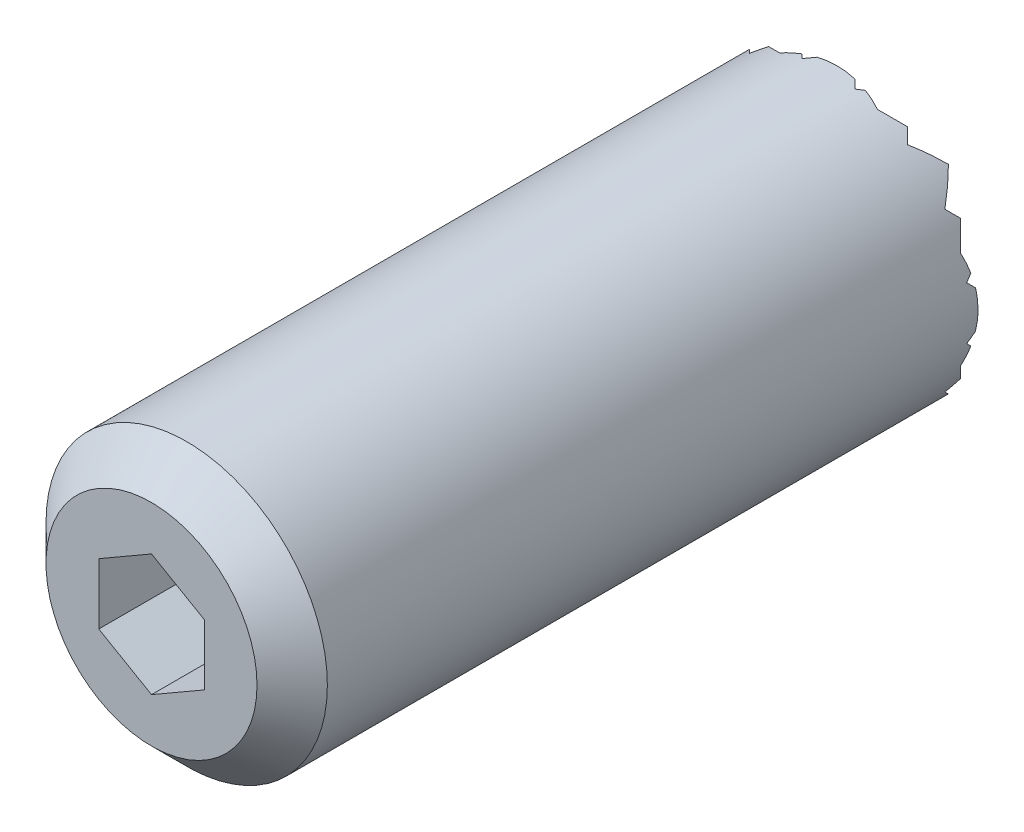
ISO-10303-21;
HEADER;
FILE_DESCRIPTION(('STEP AP214'),'2;1');
FILE_NAME('part.step','',(''),(''),'','','');
FILE_SCHEMA(('AUTOMOTIVE_DESIGN { 1 0 10303 214 1 1 1 1 }'));
ENDSEC;
DATA;
#1=APPLICATION_CONTEXT('core data for automotive mechanical design processes');
#2=APPLICATION_PROTOCOL_DEFINITION('international standard','automotive_design',2000,#1);
#3=PRODUCT_CONTEXT('',#1,'mechanical');
#4=PRODUCT('Part','Part','',(#3));
#5=PRODUCT_RELATED_PRODUCT_CATEGORY('part','',(#4));
#6=PRODUCT_DEFINITION_FORMATION('','',#4);
#7=PRODUCT_DEFINITION_CONTEXT('part definition',#1,'design');
#8=PRODUCT_DEFINITION('design','',#6,#7);
#9=PRODUCT_DEFINITION_SHAPE('','',#8);
#10=(LENGTH_UNIT() NAMED_UNIT(*) SI_UNIT(.MILLI.,.METRE.));
#11=(NAMED_UNIT(*) PLANE_ANGLE_UNIT() SI_UNIT($,.RADIAN.));
#12=(NAMED_UNIT(*) SI_UNIT($,.STERADIAN.) SOLID_ANGLE_UNIT());
#13=UNCERTAINTY_MEASURE_WITH_UNIT(LENGTH_MEASURE(1.E-05),#10,'distance_accuracy_value','');
#14=(GEOMETRIC_REPRESENTATION_CONTEXT(3) GLOBAL_UNCERTAINTY_ASSIGNED_CONTEXT((#13)) GLOBAL_UNIT_ASSIGNED_CONTEXT((#10,
#11,#12)) REPRESENTATION_CONTEXT('',''));
#15=CARTESIAN_POINT('',(0.,0.,0.));
#16=DIRECTION('',(0.,0.,1.));
#17=DIRECTION('',(1.,0.,0.));
#18=AXIS2_PLACEMENT_3D('',#15,#16,#17);
#19=CARTESIAN_POINT('',(1.49999999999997,-15.,1.5));
#20=DIRECTION('',(-0.707106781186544,0.,0.707106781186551));
#21=DIRECTION('',(0.707106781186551,0.,0.707106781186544));
#22=AXIS2_PLACEMENT_3D('',#19,#20,#21);
#23=PLANE('',#22);
#24=CARTESIAN_POINT('',(1.04517089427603E-13,0.,0.));
#25=DIRECTION('',(-0.707106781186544,0.,0.707106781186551));
#26=DIRECTION('',(0.707106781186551,0.,0.707106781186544));
#27=AXIS2_PLACEMENT_3D('',#24,#25,#26);
#28=ELLIPSE('',#27,11.3137084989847,8.);
#29=CARTESIAN_POINT('',(1.49999999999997,-7.85811682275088,1.5));
#30=VERTEX_POINT('',#29);
#31=CARTESIAN_POINT('',(1.07217269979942,-7.92782730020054,1.07217269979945));
#32=VERTEX_POINT('',#31);
#33=EDGE_CURVE('E790',#30,#32,#28,.F.);
#34=ORIENTED_EDGE('',*,*,#33,.T.);
#35=DIRECTION('',(0.57735026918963,0.577350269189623,0.577350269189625));
#36=VECTOR('',#35,1.);
#37=CARTESIAN_POINT('',(-1.00000000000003,-10.,-1.));
#38=LINE('',#37,#36);
#39=CARTESIAN_POINT('',(1.49999999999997,-7.5,1.5));
#40=VERTEX_POINT('',#39);
#41=EDGE_CURVE('E479',#32,#40,#38,.T.);
#42=ORIENTED_EDGE('',*,*,#41,.T.);
#43=DIRECTION('',(0.,1.,0.));
#44=VECTOR('',#43,1.);
#45=CARTESIAN_POINT('',(1.49999999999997,-15.,1.5));
#46=LINE('',#45,#44);
#47=EDGE_CURVE('E715',#30,#40,#46,.T.);
#48=ORIENTED_EDGE('',*,*,#47,.F.);
#49=EDGE_LOOP('',(#34,#42,#48));
#50=FACE_BOUND('',#49,.T.);
#51=ADVANCED_FACE('F14',(#50),#23,.F.);
#52=CARTESIAN_POINT('',(1.49999999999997,7.5,1.5));
#53=VERTEX_POINT('',#52);
#54=CARTESIAN_POINT('',(1.49999999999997,7.85811682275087,1.5));
#55=VERTEX_POINT('',#54);
#56=EDGE_CURVE('E718',#53,#55,#46,.T.);
#57=ORIENTED_EDGE('',*,*,#56,.F.);
#58=DIRECTION('',(-0.577350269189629,0.577350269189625,-0.577350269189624));
#59=VECTOR('',#58,1.);
#60=CARTESIAN_POINT('',(9.,0.,9.));
#61=LINE('',#60,#59);
#62=CARTESIAN_POINT('',(1.07217269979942,7.92782730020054,1.07217269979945));
#63=VERTEX_POINT('',#62);
#64=EDGE_CURVE('E466',#53,#63,#61,.T.);
#65=ORIENTED_EDGE('',*,*,#64,.T.);
#66=EDGE_CURVE('E794',#63,#55,#28,.F.);
#67=ORIENTED_EDGE('',*,*,#66,.T.);
#68=EDGE_LOOP('',(#57,#65,#67));
#69=FACE_BOUND('',#68,.T.);
#70=ADVANCED_FACE('F1142',(#69),#23,.F.);
#71=CARTESIAN_POINT('',(0.,-15.,0.));
#72=DIRECTION('',(0.707106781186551,0.,0.707106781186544));
#73=DIRECTION('',(0.707106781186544,0.,-0.707106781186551));
#74=AXIS2_PLACEMENT_3D('',#71,#72,#73);
#75=PLANE('',#74);
#76=DIRECTION('',(0.,1.,0.));
#77=VECTOR('',#76,1.);
#78=CARTESIAN_POINT('',(-1.5,-15.,1.5));
#79=LINE('',#78,#77);
#80=CARTESIAN_POINT('',(-1.5,-7.85811682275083,1.5));
#81=VERTEX_POINT('',#80);
#82=CARTESIAN_POINT('',(-1.50000000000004,-7.5,1.5));
#83=VERTEX_POINT('',#82);
#84=EDGE_CURVE('E690',#81,#83,#79,.T.);
#85=ORIENTED_EDGE('',*,*,#84,.T.);
#86=DIRECTION('',(0.577350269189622,-0.577350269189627,-0.577350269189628));
#87=VECTOR('',#86,1.);
#88=CARTESIAN_POINT('',(1.99999999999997,-11.,-2.));
#89=LINE('',#88,#87);
#90=CARTESIAN_POINT('',(-1.07217269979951,-7.92782730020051,1.0721726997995));
#91=VERTEX_POINT('',#90);
#92=EDGE_CURVE('E486',#83,#91,#89,.T.);
#93=ORIENTED_EDGE('',*,*,#92,.T.);
#94=CARTESIAN_POINT('',(1.04517089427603E-13,0.,0.));
#95=DIRECTION('',(0.707106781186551,0.,0.707106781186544));
#96=DIRECTION('',(-0.707106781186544,0.,0.707106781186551));
#97=AXIS2_PLACEMENT_3D('',#94,#95,#96);
#98=ELLIPSE('',#97,11.3137084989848,8.);
#99=EDGE_CURVE('E795',#91,#81,#98,.F.);
#100=ORIENTED_EDGE('',*,*,#99,.T.);
#101=EDGE_LOOP('',(#85,#93,#100));
#102=FACE_BOUND('',#101,.T.);
#103=ADVANCED_FACE('F1123',(#102),#75,.F.);
#104=CARTESIAN_POINT('',(-1.5,7.85811682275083,1.5));
#105=VERTEX_POINT('',#104);
#106=CARTESIAN_POINT('',(-1.07217269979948,7.92782730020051,1.0721726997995));
#107=VERTEX_POINT('',#106);
#108=EDGE_CURVE('E797',#105,#107,#98,.F.);
#109=ORIENTED_EDGE('',*,*,#108,.T.);
#110=DIRECTION('',(-0.577350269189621,-0.577350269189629,0.577350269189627));
#111=VECTOR('',#110,1.);
#112=CARTESIAN_POINT('',(-8.,0.999999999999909,8.));
#113=LINE('',#112,#111);
#114=CARTESIAN_POINT('',(-1.50000000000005,7.5,1.5));
#115=VERTEX_POINT('',#114);
#116=EDGE_CURVE('E473',#107,#115,#113,.T.);
#117=ORIENTED_EDGE('',*,*,#116,.T.);
#118=EDGE_CURVE('E695',#115,#105,#79,.T.);
#119=ORIENTED_EDGE('',*,*,#118,.T.);
#120=EDGE_LOOP('',(#109,#117,#119));
#121=FACE_BOUND('',#120,.T.);
#122=ADVANCED_FACE('F968',(#121),#75,.F.);
#123=CARTESIAN_POINT('',(-1.5,-15.,1.5));
#124=DIRECTION('',(-0.707106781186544,0.,0.707106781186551));
#125=DIRECTION('',(0.707106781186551,0.,0.707106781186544));
#126=AXIS2_PLACEMENT_3D('',#123,#124,#125);
#127=PLANE('',#126);
#128=CARTESIAN_POINT('',(1.04517089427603E-13,0.,3.));
#129=DIRECTION('',(-0.707106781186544,0.,0.707106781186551));
#130=DIRECTION('',(0.707106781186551,0.,0.707106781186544));
#131=AXIS2_PLACEMENT_3D('',#128,#129,#130);
#132=ELLIPSE('',#131,11.3137084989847,8.);
#133=CARTESIAN_POINT('',(-1.79583152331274,-7.79583152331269,1.2041684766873));
#134=VERTEX_POINT('',#133);
#135=EDGE_CURVE('E798',#81,#134,#132,.F.);
#136=ORIENTED_EDGE('',*,*,#135,.T.);
#137=DIRECTION('',(0.57735026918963,0.577350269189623,0.577350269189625));
#138=VECTOR('',#137,1.);
#139=CARTESIAN_POINT('',(-4.,-10.,-1.));
#140=LINE('',#139,#138);
#141=EDGE_CURVE('E489',#134,#83,#140,.T.);
#142=ORIENTED_EDGE('',*,*,#141,.T.);
#143=ORIENTED_EDGE('',*,*,#84,.F.);
#144=EDGE_LOOP('',(#136,#142,#143));
#145=FACE_BOUND('',#144,.T.);
#146=ADVANCED_FACE('F1120',(#145),#127,.F.);
#147=ORIENTED_EDGE('',*,*,#118,.F.);
#148=DIRECTION('',(-0.577350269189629,0.577350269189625,-0.577350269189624));
#149=VECTOR('',#148,1.);
#150=CARTESIAN_POINT('',(6.,0.,9.));
#151=LINE('',#150,#149);
#152=CARTESIAN_POINT('',(-1.79583152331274,7.79583152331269,1.2041684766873));
#153=VERTEX_POINT('',#152);
#154=EDGE_CURVE('E476',#115,#153,#151,.T.);
#155=ORIENTED_EDGE('',*,*,#154,.T.);
#156=EDGE_CURVE('E801',#153,#105,#132,.F.);
#157=ORIENTED_EDGE('',*,*,#156,.T.);
#158=EDGE_LOOP('',(#147,#155,#157));
#159=FACE_BOUND('',#158,.T.);
#160=ADVANCED_FACE('F972',(#159),#127,.F.);
#161=CARTESIAN_POINT('',(-3.,-15.,0.));
#162=DIRECTION('',(0.707106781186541,0.,0.707106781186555));
#163=DIRECTION('',(0.707106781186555,0.,-0.707106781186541));
#164=AXIS2_PLACEMENT_3D('',#161,#162,#163);
#165=PLANE('',#164);
#166=DIRECTION('',(0.577350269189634,-0.57735026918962,-0.577350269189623));
#167=VECTOR('',#166,1.);
#168=CARTESIAN_POINT('',(0.,-9.,-3.));
#169=LINE('',#168,#167);
#170=CARTESIAN_POINT('',(-4.50000000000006,-4.5,1.5));
#171=VERTEX_POINT('',#170);
#172=CARTESIAN_POINT('',(-3.,-6.,0.));
#173=VERTEX_POINT('',#172);
#174=EDGE_CURVE('E528',#171,#173,#169,.T.);
#175=ORIENTED_EDGE('',*,*,#174,.T.);
#176=DIRECTION('',(-0.577350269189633,-0.577350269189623,0.577350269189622));
#177=VECTOR('',#176,1.);
#178=CARTESIAN_POINT('',(-6.,-9.,3.));
#179=LINE('',#178,#177);
#180=CARTESIAN_POINT('',(-3.95435605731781,-6.95435605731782,0.9543560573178));
#181=VERTEX_POINT('',#180);
#182=EDGE_CURVE('E507',#173,#181,#179,.T.);
#183=ORIENTED_EDGE('',*,*,#182,.T.);
#184=CARTESIAN_POINT('',(1.04517089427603E-13,0.,-3.));
#185=DIRECTION('',(0.707106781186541,0.,0.707106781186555));
#186=DIRECTION('',(-0.707106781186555,0.,0.707106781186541));
#187=AXIS2_PLACEMENT_3D('',#184,#185,#186);
#188=ELLIPSE('',#187,11.3137084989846,8.);
#189=CARTESIAN_POINT('',(-4.5,-6.61437827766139,1.5));
#190=VERTEX_POINT('',#189);
#191=EDGE_CURVE('E802',#181,#190,#188,.F.);
#192=ORIENTED_EDGE('',*,*,#191,.T.);
#193=DIRECTION('',(0.,1.,0.));
#194=VECTOR('',#193,1.);
#195=CARTESIAN_POINT('',(-4.5,-15.,1.5));
#196=LINE('',#195,#194);
#197=EDGE_CURVE('E696',#190,#171,#196,.T.);
#198=ORIENTED_EDGE('',*,*,#197,.T.);
#199=EDGE_LOOP('',(#175,#183,#192,#198));
#200=FACE_BOUND('',#199,.T.);
#201=ADVANCED_FACE('F1092',(#200),#165,.F.);
#202=CARTESIAN_POINT('',(-4.5,6.61437827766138,1.5));
#203=VERTEX_POINT('',#202);
#204=CARTESIAN_POINT('',(-3.95435605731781,6.95435605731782,0.9543560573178));
#205=VERTEX_POINT('',#204);
#206=EDGE_CURVE('E804',#203,#205,#188,.F.);
#207=ORIENTED_EDGE('',*,*,#206,.T.);
#208=DIRECTION('',(0.577350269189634,-0.57735026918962,-0.577350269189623));
#209=VECTOR('',#208,1.);
#210=CARTESIAN_POINT('',(4.,-0.999999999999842,-7.));
#211=LINE('',#210,#209);
#212=CARTESIAN_POINT('',(-3.,6.,0.));
#213=VERTEX_POINT('',#212);
#214=EDGE_CURVE('E464',#205,#213,#211,.T.);
#215=ORIENTED_EDGE('',*,*,#214,.T.);
#216=DIRECTION('',(-0.577350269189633,-0.577350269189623,0.577350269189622));
#217=VECTOR('',#216,1.);
#218=CARTESIAN_POINT('',(-10.,-0.999999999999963,7.));
#219=LINE('',#218,#217);
#220=CARTESIAN_POINT('',(-4.5,4.5,1.5));
#221=VERTEX_POINT('',#220);
#222=EDGE_CURVE('E443',#213,#221,#219,.T.);
#223=ORIENTED_EDGE('',*,*,#222,.T.);
#224=EDGE_CURVE('E700',#221,#203,#196,.T.);
#225=ORIENTED_EDGE('',*,*,#224,.T.);
#226=EDGE_LOOP('',(#207,#215,#223,#225));
#227=FACE_BOUND('',#226,.T.);
#228=ADVANCED_FACE('F1591',(#227),#165,.F.);
#229=CARTESIAN_POINT('',(-4.5,-15.,1.5));
#230=DIRECTION('',(-0.707106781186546,0.,0.707106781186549));
#231=DIRECTION('',(0.707106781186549,0.,0.707106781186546));
#232=AXIS2_PLACEMENT_3D('',#229,#230,#231);
#233=PLANE('',#232);
#234=CARTESIAN_POINT('',(1.04517089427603E-13,0.,6.));
#235=DIRECTION('',(-0.707106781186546,0.,0.707106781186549));
#236=DIRECTION('',(0.707106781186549,0.,0.707106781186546));
#237=AXIS2_PLACEMENT_3D('',#234,#235,#236);
#238=ELLIPSE('',#237,11.3137084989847,8.);
#239=CARTESIAN_POINT('',(-5.65685424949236,-5.6568542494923,0.3431457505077));
#240=VERTEX_POINT('',#239);
#241=EDGE_CURVE('E805',#190,#240,#238,.F.);
#242=ORIENTED_EDGE('',*,*,#241,.T.);
#243=DIRECTION('',(0.577350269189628,0.577350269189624,0.577350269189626));
#244=VECTOR('',#243,1.);
#245=CARTESIAN_POINT('',(-8.,-8.,-2.));
#246=LINE('',#245,#244);
#247=EDGE_CURVE('E530',#240,#171,#246,.T.);
#248=ORIENTED_EDGE('',*,*,#247,.T.);
#249=ORIENTED_EDGE('',*,*,#197,.F.);
#250=EDGE_LOOP('',(#242,#248,#249));
#251=FACE_BOUND('',#250,.T.);
#252=ADVANCED_FACE('F1087',(#251),#233,.F.);
#253=ORIENTED_EDGE('',*,*,#224,.F.);
#254=DIRECTION('',(-0.577350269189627,0.577350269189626,-0.577350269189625));
#255=VECTOR('',#254,1.);
#256=CARTESIAN_POINT('',(1.99999999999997,-2.00000000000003,8.));
#257=LINE('',#256,#255);
#258=CARTESIAN_POINT('',(-5.65685424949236,5.6568542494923,0.3431457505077));
#259=VERTEX_POINT('',#258);
#260=EDGE_CURVE('E446',#221,#259,#257,.T.);
#261=ORIENTED_EDGE('',*,*,#260,.T.);
#262=EDGE_CURVE('E808',#259,#203,#238,.F.);
#263=ORIENTED_EDGE('',*,*,#262,.T.);
#264=EDGE_LOOP('',(#253,#261,#263));
#265=FACE_BOUND('',#264,.T.);
#266=ADVANCED_FACE('F1596',(#265),#233,.F.);
#267=CARTESIAN_POINT('',(-6.,-15.,0.));
#268=DIRECTION('',(0.70710678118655,0.,0.707106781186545));
#269=DIRECTION('',(0.707106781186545,0.,-0.70710678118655));
#270=AXIS2_PLACEMENT_3D('',#267,#268,#269);
#271=PLANE('',#270);
#272=DIRECTION('',(0.577350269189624,-0.577350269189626,-0.577350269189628));
#273=VECTOR('',#272,1.);
#274=CARTESIAN_POINT('',(-2.00000000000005,-7.,-4.));
#275=LINE('',#274,#273);
#276=CARTESIAN_POINT('',(-7.5,-1.5,1.5));
#277=VERTEX_POINT('',#276);
#278=CARTESIAN_POINT('',(-6.,-3.,0.));
#279=VERTEX_POINT('',#278);
#280=EDGE_CURVE('E590',#277,#279,#275,.T.);
#281=ORIENTED_EDGE('',*,*,#280,.T.);
#282=DIRECTION('',(-0.577350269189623,-0.577350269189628,0.577350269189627));
#283=VECTOR('',#282,1.);
#284=CARTESIAN_POINT('',(-10.,-7.,4.));
#285=LINE('',#284,#283);
#286=CARTESIAN_POINT('',(-6.9543560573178,-3.95435605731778,0.9543560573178));
#287=VERTEX_POINT('',#286);
#288=EDGE_CURVE('E558',#279,#287,#285,.T.);
#289=ORIENTED_EDGE('',*,*,#288,.T.);
#290=CARTESIAN_POINT('',(1.04517089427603E-13,0.,-6.));
#291=DIRECTION('',(0.70710678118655,0.,0.707106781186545));
#292=DIRECTION('',(-0.707106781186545,0.,0.70710678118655));
#293=AXIS2_PLACEMENT_3D('',#290,#291,#292);
#294=ELLIPSE('',#293,11.3137084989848,8.);
#295=CARTESIAN_POINT('',(-7.5,-2.78388218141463,1.5));
#296=VERTEX_POINT('',#295);
#297=EDGE_CURVE('E809',#287,#296,#294,.F.);
#298=ORIENTED_EDGE('',*,*,#297,.T.);
#299=DIRECTION('',(0.,1.,0.));
#300=VECTOR('',#299,1.);
#301=CARTESIAN_POINT('',(-7.5,-15.,1.5));
#302=LINE('',#301,#300);
#303=EDGE_CURVE('E701',#296,#277,#302,.T.);
#304=ORIENTED_EDGE('',*,*,#303,.T.);
#305=EDGE_LOOP('',(#281,#289,#298,#304));
#306=FACE_BOUND('',#305,.T.);
#307=ADVANCED_FACE('F1615',(#306),#271,.F.);
#308=DIRECTION('',(0.577350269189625,-0.577350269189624,-0.577350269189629));
#309=VECTOR('',#308,1.);
#310=CARTESIAN_POINT('',(-1.00000000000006,-5.,-5.));
#311=LINE('',#310,#309);
#312=CARTESIAN_POINT('',(-7.5,1.5,1.5));
#313=VERTEX_POINT('',#312);
#314=CARTESIAN_POINT('',(-6.,0.,0.));
#315=VERTEX_POINT('',#314);
#316=EDGE_CURVE('E658',#313,#315,#311,.T.);
#317=ORIENTED_EDGE('',*,*,#316,.T.);
#318=DIRECTION('',(-0.577350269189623,-0.577350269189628,0.577350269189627));
#319=VECTOR('',#318,1.);
#320=CARTESIAN_POINT('',(-11.,-5.,5.));
#321=LINE('',#320,#319);
#322=EDGE_CURVE('E623',#315,#277,#321,.T.);
#323=ORIENTED_EDGE('',*,*,#322,.T.);
#324=EDGE_CURVE('E704',#277,#313,#302,.T.);
#325=ORIENTED_EDGE('',*,*,#324,.T.);
#326=EDGE_LOOP('',(#317,#323,#325));
#327=FACE_BOUND('',#326,.T.);
#328=ADVANCED_FACE('F1620',(#327),#271,.F.);
#329=CARTESIAN_POINT('',(-7.5,-15.,1.5));
#330=DIRECTION('',(-0.707106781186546,0.,0.707106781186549));
#331=DIRECTION('',(0.707106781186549,0.,0.707106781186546));
#332=AXIS2_PLACEMENT_3D('',#329,#330,#331);
#333=PLANE('',#332);
#334=CARTESIAN_POINT('',(-7.5,2.78388218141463,1.5));
#335=VERTEX_POINT('',#334);
#336=EDGE_CURVE('E705',#313,#335,#302,.T.);
#337=ORIENTED_EDGE('',*,*,#336,.F.);
#338=DIRECTION('',(-0.577350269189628,0.577350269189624,-0.577350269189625));
#339=VECTOR('',#338,1.);
#340=CARTESIAN_POINT('',(-2.00000000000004,-4.,7.));
#341=LINE('',#340,#339);
#342=CARTESIAN_POINT('',(-7.79583152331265,1.79583152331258,1.2041684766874));
#343=VERTEX_POINT('',#342);
#344=EDGE_CURVE('E687',#313,#343,#341,.T.);
#345=ORIENTED_EDGE('',*,*,#344,.T.);
#346=CARTESIAN_POINT('',(1.04517089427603E-13,0.,9.));
#347=DIRECTION('',(-0.707106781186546,0.,0.707106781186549));
#348=DIRECTION('',(0.707106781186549,0.,0.707106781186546));
#349=AXIS2_PLACEMENT_3D('',#346,#347,#348);
#350=ELLIPSE('',#349,11.3137084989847,8.);
#351=EDGE_CURVE('E816',#343,#335,#350,.F.);
#352=ORIENTED_EDGE('',*,*,#351,.T.);
#353=EDGE_LOOP('',(#337,#345,#352));
#354=FACE_BOUND('',#353,.T.);
#355=ADVANCED_FACE('F1632',(#354),#333,.F.);
#356=CARTESIAN_POINT('',(-7.92782730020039,-1.07217269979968,1.0721726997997));
#357=VERTEX_POINT('',#356);
#358=CARTESIAN_POINT('',(-7.9278273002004,1.07217269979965,1.07217269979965));
#359=VERTEX_POINT('',#358);
#360=EDGE_CURVE('E815',#357,#359,#350,.F.);
#361=ORIENTED_EDGE('',*,*,#360,.T.);
#362=DIRECTION('',(0.577350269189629,0.577350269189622,0.577350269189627));
#363=VECTOR('',#362,1.);
#364=CARTESIAN_POINT('',(-13.,-3.99999999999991,-4.));
#365=LINE('',#364,#363);
#366=EDGE_CURVE('E660',#359,#313,#365,.T.);
#367=ORIENTED_EDGE('',*,*,#366,.T.);
#368=ORIENTED_EDGE('',*,*,#324,.F.);
#369=DIRECTION('',(-0.577350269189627,0.577350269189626,-0.577350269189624));
#370=VECTOR('',#369,1.);
#371=CARTESIAN_POINT('',(-3.00000000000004,-6.,6.));
#372=LINE('',#371,#370);
#373=EDGE_CURVE('E626',#277,#357,#372,.T.);
#374=ORIENTED_EDGE('',*,*,#373,.T.);
#375=EDGE_LOOP('',(#361,#367,#368,#374));
#376=FACE_BOUND('',#375,.T.);
#377=ADVANCED_FACE('F982',(#376),#333,.F.);
#378=CARTESIAN_POINT('',(9.,-15.,0.));
#379=DIRECTION('',(0.707106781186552,0.,0.707106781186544));
#380=DIRECTION('',(0.707106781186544,0.,-0.707106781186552));
#381=AXIS2_PLACEMENT_3D('',#378,#379,#380);
#382=PLANE('',#381);
#383=CARTESIAN_POINT('',(1.04517089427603E-13,0.,9.));
#384=DIRECTION('',(0.707106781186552,0.,0.707106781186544));
#385=DIRECTION('',(-0.707106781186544,0.,0.707106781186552));
#386=AXIS2_PLACEMENT_3D('',#383,#384,#385);
#387=ELLIPSE('',#386,11.3137084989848,8.);
#388=CARTESIAN_POINT('',(7.5,2.78388218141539,1.5));
#389=VERTEX_POINT('',#388);
#390=CARTESIAN_POINT('',(7.79583152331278,1.79583152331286,1.20416847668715));
#391=VERTEX_POINT('',#390);
#392=EDGE_CURVE('E787',#389,#391,#387,.F.);
#393=ORIENTED_EDGE('',*,*,#392,.T.);
#394=DIRECTION('',(-0.577350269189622,-0.577350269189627,0.577350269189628));
#395=VECTOR('',#394,1.);
#396=CARTESIAN_POINT('',(2.99999999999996,-3.,6.));
#397=LINE('',#396,#395);
#398=CARTESIAN_POINT('',(7.5,1.5,1.5));
#399=VERTEX_POINT('',#398);
#400=EDGE_CURVE('E395',#391,#399,#397,.T.);
#401=ORIENTED_EDGE('',*,*,#400,.T.);
#402=DIRECTION('',(0.,1.,0.));
#403=VECTOR('',#402,1.);
#404=CARTESIAN_POINT('',(7.5,-15.,1.5));
#405=LINE('',#404,#403);
#406=EDGE_CURVE('E393',#399,#389,#405,.T.);
#407=ORIENTED_EDGE('',*,*,#406,.T.);
#408=EDGE_LOOP('',(#393,#401,#407));
#409=FACE_BOUND('',#408,.T.);
#410=ADVANCED_FACE('F1745',(#409),#382,.F.);
#411=CARTESIAN_POINT('',(7.5,-1.5,1.5));
#412=VERTEX_POINT('',#411);
#413=EDGE_CURVE('E709',#412,#399,#405,.T.);
#414=ORIENTED_EDGE('',*,*,#413,.T.);
#415=DIRECTION('',(0.577350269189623,-0.577350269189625,-0.57735026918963));
#416=VECTOR('',#415,1.);
#417=CARTESIAN_POINT('',(14.,-5.,-5.));
#418=LINE('',#417,#416);
#419=CARTESIAN_POINT('',(7.92782730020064,1.07217269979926,1.07217269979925));
#420=VERTEX_POINT('',#419);
#421=EDGE_CURVE('E638',#399,#420,#418,.T.);
#422=ORIENTED_EDGE('',*,*,#421,.T.);
#423=CARTESIAN_POINT('',(7.92782730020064,-1.07217269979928,1.07217269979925));
#424=VERTEX_POINT('',#423);
#425=EDGE_CURVE('E791',#420,#424,#387,.F.);
#426=ORIENTED_EDGE('',*,*,#425,.T.);
#427=DIRECTION('',(-0.577350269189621,-0.577350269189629,0.577350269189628));
#428=VECTOR('',#427,1.);
#429=CARTESIAN_POINT('',(3.99999999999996,-5.,5.));
#430=LINE('',#429,#428);
#431=EDGE_CURVE('E604',#424,#412,#430,.T.);
#432=ORIENTED_EDGE('',*,*,#431,.T.);
#433=EDGE_LOOP('',(#414,#422,#426,#432));
#434=FACE_BOUND('',#433,.T.);
#435=ADVANCED_FACE('F1449',(#434),#382,.F.);
#436=CARTESIAN_POINT('',(7.5,-15.,1.5));
#437=DIRECTION('',(-0.707106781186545,0.,0.70710678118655));
#438=DIRECTION('',(0.707106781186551,0.,0.707106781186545));
#439=AXIS2_PLACEMENT_3D('',#436,#437,#438);
#440=PLANE('',#439);
#441=CARTESIAN_POINT('',(1.04517089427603E-13,0.,-6.));
#442=DIRECTION('',(-0.707106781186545,0.,0.70710678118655));
#443=DIRECTION('',(0.707106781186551,0.,0.707106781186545));
#444=AXIS2_PLACEMENT_3D('',#441,#442,#443);
#445=ELLIPSE('',#444,11.3137084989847,8.);
#446=CARTESIAN_POINT('',(7.5,-2.78388218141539,1.5));
#447=VERTEX_POINT('',#446);
#448=CARTESIAN_POINT('',(6.95435605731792,-3.95435605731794,0.954356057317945));
#449=VERTEX_POINT('',#448);
#450=EDGE_CURVE('E781',#447,#449,#445,.F.);
#451=ORIENTED_EDGE('',*,*,#450,.T.);
#452=DIRECTION('',(-0.577350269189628,0.577350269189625,-0.577350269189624));
#453=VECTOR('',#452,1.);
#454=CARTESIAN_POINT('',(11.,-8.,5.));
#455=LINE('',#454,#453);
#456=CARTESIAN_POINT('',(6.,-3.,0.));
#457=VERTEX_POINT('',#456);
#458=EDGE_CURVE('E539',#449,#457,#455,.T.);
#459=ORIENTED_EDGE('',*,*,#458,.T.);
#460=DIRECTION('',(0.57735026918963,0.577350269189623,0.577350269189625));
#461=VECTOR('',#460,1.);
#462=CARTESIAN_POINT('',(2.99999999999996,-6.,-3.));
#463=LINE('',#462,#461);
#464=EDGE_CURVE('E567',#457,#412,#463,.T.);
#465=ORIENTED_EDGE('',*,*,#464,.T.);
#466=EDGE_CURVE('E706',#447,#412,#405,.T.);
#467=ORIENTED_EDGE('',*,*,#466,.F.);
#468=EDGE_LOOP('',(#451,#459,#465,#467));
#469=FACE_BOUND('',#468,.T.);
#470=ADVANCED_FACE('F1460',(#469),#440,.F.);
#471=ORIENTED_EDGE('',*,*,#413,.F.);
#472=DIRECTION('',(-0.577350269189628,0.577350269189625,-0.577350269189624));
#473=VECTOR('',#472,1.);
#474=CARTESIAN_POINT('',(12.,-6.,6.));
#475=LINE('',#474,#473);
#476=CARTESIAN_POINT('',(6.,0.,0.));
#477=VERTEX_POINT('',#476);
#478=EDGE_CURVE('E601',#412,#477,#475,.T.);
#479=ORIENTED_EDGE('',*,*,#478,.T.);
#480=DIRECTION('',(0.577350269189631,0.577350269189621,0.577350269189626));
#481=VECTOR('',#480,1.);
#482=CARTESIAN_POINT('',(2.,-3.99999999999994,-4.));
#483=LINE('',#482,#481);
#484=EDGE_CURVE('E635',#477,#399,#483,.T.);
#485=ORIENTED_EDGE('',*,*,#484,.T.);
#486=EDGE_LOOP('',(#471,#479,#485));
#487=FACE_BOUND('',#486,.T.);
#488=ADVANCED_FACE('F1501',(#487),#440,.F.);
#489=CARTESIAN_POINT('',(6.,-15.,0.));
#490=DIRECTION('',(0.707106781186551,0.,0.707106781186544));
#491=DIRECTION('',(0.707106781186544,0.,-0.707106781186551));
#492=AXIS2_PLACEMENT_3D('',#489,#490,#491);
#493=PLANE('',#492);
#494=DIRECTION('',(0.,1.,0.));
#495=VECTOR('',#494,1.);
#496=CARTESIAN_POINT('',(4.5,-15.,1.5));
#497=LINE('',#496,#495);
#498=CARTESIAN_POINT('',(4.5,-6.61437827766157,1.5));
#499=VERTEX_POINT('',#498);
#500=CARTESIAN_POINT('',(4.5,-4.5,1.5));
#501=VERTEX_POINT('',#500);
#502=EDGE_CURVE('E710',#499,#501,#497,.T.);
#503=ORIENTED_EDGE('',*,*,#502,.T.);
#504=DIRECTION('',(0.577350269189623,-0.577350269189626,-0.577350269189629));
#505=VECTOR('',#504,1.);
#506=CARTESIAN_POINT('',(9.,-9.,-3.));
#507=LINE('',#506,#505);
#508=CARTESIAN_POINT('',(5.6568542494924,-5.65685424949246,0.343145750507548));
#509=VERTEX_POINT('',#508);
#510=EDGE_CURVE('E513',#501,#509,#507,.T.);
#511=ORIENTED_EDGE('',*,*,#510,.T.);
#512=CARTESIAN_POINT('',(1.04517089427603E-13,0.,6.));
#513=DIRECTION('',(0.707106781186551,0.,0.707106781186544));
#514=DIRECTION('',(-0.707106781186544,0.,0.707106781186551));
#515=AXIS2_PLACEMENT_3D('',#512,#513,#514);
#516=ELLIPSE('',#515,11.3137084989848,8.);
#517=EDGE_CURVE('E778',#509,#499,#516,.F.);
#518=ORIENTED_EDGE('',*,*,#517,.T.);
#519=EDGE_LOOP('',(#503,#511,#518));
#520=FACE_BOUND('',#519,.T.);
#521=ADVANCED_FACE('F1548',(#520),#493,.F.);
#522=CARTESIAN_POINT('',(4.5,6.61437827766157,1.5));
#523=VERTEX_POINT('',#522);
#524=CARTESIAN_POINT('',(5.6568542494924,5.65685424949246,0.343145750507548));
#525=VERTEX_POINT('',#524);
#526=EDGE_CURVE('E782',#523,#525,#516,.F.);
#527=ORIENTED_EDGE('',*,*,#526,.T.);
#528=DIRECTION('',(-0.577350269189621,-0.577350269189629,0.577350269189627));
#529=VECTOR('',#528,1.);
#530=CARTESIAN_POINT('',(-1.00000000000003,-1.00000000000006,7.));
#531=LINE('',#530,#529);
#532=CARTESIAN_POINT('',(4.5,4.5,1.5));
#533=VERTEX_POINT('',#532);
#534=EDGE_CURVE('E428',#525,#533,#531,.T.);
#535=ORIENTED_EDGE('',*,*,#534,.T.);
#536=EDGE_CURVE('E714',#533,#523,#497,.T.);
#537=ORIENTED_EDGE('',*,*,#536,.T.);
#538=EDGE_LOOP('',(#527,#535,#537));
#539=FACE_BOUND('',#538,.T.);
#540=ADVANCED_FACE('F1540',(#539),#493,.F.);
#541=CARTESIAN_POINT('',(4.5,-15.,1.5));
#542=DIRECTION('',(-0.707106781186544,0.,0.707106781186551));
#543=DIRECTION('',(0.707106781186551,0.,0.707106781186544));
#544=AXIS2_PLACEMENT_3D('',#541,#542,#543);
#545=PLANE('',#544);
#546=CARTESIAN_POINT('',(1.04517089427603E-13,0.,-3.));
#547=DIRECTION('',(-0.707106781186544,0.,0.707106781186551));
#548=DIRECTION('',(0.707106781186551,0.,0.707106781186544));
#549=AXIS2_PLACEMENT_3D('',#546,#547,#548);
#550=ELLIPSE('',#549,11.3137084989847,8.);
#551=CARTESIAN_POINT('',(3.95435605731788,-6.9543560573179,0.954356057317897));
#552=VERTEX_POINT('',#551);
#553=EDGE_CURVE('E774',#499,#552,#550,.F.);
#554=ORIENTED_EDGE('',*,*,#553,.T.);
#555=DIRECTION('',(-0.577350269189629,0.577350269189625,-0.577350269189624));
#556=VECTOR('',#555,1.);
#557=CARTESIAN_POINT('',(7.,-10.,4.));
#558=LINE('',#557,#556);
#559=CARTESIAN_POINT('',(3.,-6.,0.));
#560=VERTEX_POINT('',#559);
#561=EDGE_CURVE('E492',#552,#560,#558,.T.);
#562=ORIENTED_EDGE('',*,*,#561,.T.);
#563=DIRECTION('',(0.57735026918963,0.577350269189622,0.577350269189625));
#564=VECTOR('',#563,1.);
#565=CARTESIAN_POINT('',(0.999999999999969,-8.,-2.));
#566=LINE('',#565,#564);
#567=EDGE_CURVE('E510',#560,#501,#566,.T.);
#568=ORIENTED_EDGE('',*,*,#567,.T.);
#569=ORIENTED_EDGE('',*,*,#502,.F.);
#570=EDGE_LOOP('',(#554,#562,#568,#569));
#571=FACE_BOUND('',#570,.T.);
#572=ADVANCED_FACE('F864',(#571),#545,.F.);
#573=DIRECTION('',(-0.577350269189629,0.577350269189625,-0.577350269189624));
#574=VECTOR('',#573,1.);
#575=CARTESIAN_POINT('',(11.,-2.,8.));
#576=LINE('',#575,#574);
#577=CARTESIAN_POINT('',(3.,6.,0.));
#578=VERTEX_POINT('',#577);
#579=EDGE_CURVE('E425',#533,#578,#576,.T.);
#580=ORIENTED_EDGE('',*,*,#579,.T.);
#581=DIRECTION('',(0.57735026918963,0.577350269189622,0.577350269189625));
#582=VECTOR('',#581,1.);
#583=CARTESIAN_POINT('',(-3.00000000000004,0.,-6.));
#584=LINE('',#583,#582);
#585=CARTESIAN_POINT('',(3.95435605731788,6.9543560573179,0.954356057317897));
#586=VERTEX_POINT('',#585);
#587=EDGE_CURVE('E449',#578,#586,#584,.T.);
#588=ORIENTED_EDGE('',*,*,#587,.T.);
#589=EDGE_CURVE('E779',#586,#523,#550,.F.);
#590=ORIENTED_EDGE('',*,*,#589,.T.);
#591=ORIENTED_EDGE('',*,*,#536,.F.);
#592=EDGE_LOOP('',(#580,#588,#590,#591));
#593=FACE_BOUND('',#592,.T.);
#594=ADVANCED_FACE('F1530',(#593),#545,.F.);
#595=CARTESIAN_POINT('',(3.,-15.,0.));
#596=DIRECTION('',(0.707106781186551,0.,0.707106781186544));
#597=DIRECTION('',(0.707106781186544,0.,-0.707106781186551));
#598=AXIS2_PLACEMENT_3D('',#595,#596,#597);
#599=PLANE('',#598);
#600=ORIENTED_EDGE('',*,*,#47,.T.);
#601=DIRECTION('',(0.577350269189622,-0.577350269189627,-0.577350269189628));
#602=VECTOR('',#601,1.);
#603=CARTESIAN_POINT('',(5.,-11.,-2.));
#604=LINE('',#603,#602);
#605=CARTESIAN_POINT('',(1.79583152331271,-7.79583152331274,1.20416847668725));
#606=VERTEX_POINT('',#605);
#607=EDGE_CURVE('E9',#40,#606,#604,.T.);
#608=ORIENTED_EDGE('',*,*,#607,.T.);
#609=CARTESIAN_POINT('',(1.04517089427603E-13,0.,3.));
#610=DIRECTION('',(0.707106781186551,0.,0.707106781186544));
#611=DIRECTION('',(-0.707106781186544,0.,0.707106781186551));
#612=AXIS2_PLACEMENT_3D('',#609,#610,#611);
#613=ELLIPSE('',#612,11.3137084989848,8.);
#614=EDGE_CURVE('E772',#606,#30,#613,.F.);
#615=ORIENTED_EDGE('',*,*,#614,.T.);
#616=EDGE_LOOP('',(#600,#608,#615));
#617=FACE_BOUND('',#616,.T.);
#618=ADVANCED_FACE('F1166',(#617),#599,.F.);
#619=CARTESIAN_POINT('',(1.79583152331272,7.79583152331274,1.20416847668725));
#620=VERTEX_POINT('',#619);
#621=EDGE_CURVE('E775',#55,#620,#613,.F.);
#622=ORIENTED_EDGE('',*,*,#621,.T.);
#623=DIRECTION('',(-0.577350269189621,-0.577350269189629,0.577350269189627));
#624=VECTOR('',#623,1.);
#625=CARTESIAN_POINT('',(-5.,0.999999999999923,8.));
#626=LINE('',#625,#624);
#627=EDGE_CURVE('E826',#620,#53,#626,.T.);
#628=ORIENTED_EDGE('',*,*,#627,.T.);
#629=ORIENTED_EDGE('',*,*,#56,.T.);
#630=EDGE_LOOP('',(#622,#628,#629));
#631=FACE_BOUND('',#630,.T.);
#632=ADVANCED_FACE('F1180',(#631),#599,.F.);
#633=CARTESIAN_POINT('',(1.04517089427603E-13,0.,60.));
#634=DIRECTION('',(0.,0.,1.));
#635=DIRECTION('',(1.,0.,0.));
#636=AXIS2_PLACEMENT_3D('',#633,#634,#635);
#637=CYLINDRICAL_SURFACE('',#636,8.);
#638=CARTESIAN_POINT('',(1.04517089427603E-13,0.,3.));
#639=DIRECTION('',(0.,0.707106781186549,0.707106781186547));
#640=DIRECTION('',(0.,-0.707106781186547,0.707106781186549));
#641=AXIS2_PLACEMENT_3D('',#638,#639,#640);
#642=ELLIPSE('',#641,11.3137084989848,8.);
#643=CARTESIAN_POINT('',(7.85811682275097,1.5,1.5));
#644=VERTEX_POINT('',#643);
#645=EDGE_CURVE('E669',#391,#644,#642,.F.);
#646=ORIENTED_EDGE('',*,*,#645,.F.);
#647=ORIENTED_EDGE('',*,*,#392,.F.);
#648=CARTESIAN_POINT('',(6.95435605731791,3.95435605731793,0.954356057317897));
#649=VERTEX_POINT('',#648);
#650=EDGE_CURVE('E786',#649,#389,#445,.F.);
#651=ORIENTED_EDGE('',*,*,#650,.F.);
#652=CARTESIAN_POINT('',(1.04517089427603E-13,0.,-3.));
#653=DIRECTION('',(0.,-0.707106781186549,0.707106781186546));
#654=DIRECTION('',(0.,0.707106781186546,0.707106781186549));
#655=AXIS2_PLACEMENT_3D('',#652,#653,#654);
#656=ELLIPSE('',#655,11.3137084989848,8.);
#657=CARTESIAN_POINT('',(6.61437827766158,4.5,1.5));
#658=VERTEX_POINT('',#657);
#659=EDGE_CURVE('E385',#658,#649,#656,.F.);
#660=ORIENTED_EDGE('',*,*,#659,.F.);
#661=CARTESIAN_POINT('',(1.04517089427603E-13,0.,6.));
#662=DIRECTION('',(0.,0.707106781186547,0.707106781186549));
#663=DIRECTION('',(0.,-0.707106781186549,0.707106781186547));
#664=AXIS2_PLACEMENT_3D('',#661,#662,#663);
#665=ELLIPSE('',#664,11.3137084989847,8.);
#666=EDGE_CURVE('E434',#525,#658,#665,.F.);
#667=ORIENTED_EDGE('',*,*,#666,.F.);
#668=ORIENTED_EDGE('',*,*,#526,.F.);
#669=ORIENTED_EDGE('',*,*,#589,.F.);
#670=CARTESIAN_POINT('',(1.04517089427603E-13,0.,-6.));
#671=DIRECTION('',(0.,-0.707106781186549,0.707106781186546));
#672=DIRECTION('',(0.,0.707106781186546,0.707106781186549));
#673=AXIS2_PLACEMENT_3D('',#670,#671,#672);
#674=ELLIPSE('',#673,11.3137084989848,8.);
#675=CARTESIAN_POINT('',(2.78388218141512,7.5,1.5));
#676=VERTEX_POINT('',#675);
#677=EDGE_CURVE('E455',#676,#586,#674,.F.);
#678=ORIENTED_EDGE('',*,*,#677,.F.);
#679=CARTESIAN_POINT('',(1.04517089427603E-13,0.,9.));
#680=DIRECTION('',(0.,0.707106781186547,0.707106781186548));
#681=DIRECTION('',(0.,-0.707106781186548,0.707106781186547));
#682=AXIS2_PLACEMENT_3D('',#679,#680,#681);
#683=ELLIPSE('',#682,11.3137084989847,8.);
#684=EDGE_CURVE('E469',#620,#676,#683,.F.);
#685=ORIENTED_EDGE('',*,*,#684,.F.);
#686=ORIENTED_EDGE('',*,*,#621,.F.);
#687=ORIENTED_EDGE('',*,*,#66,.F.);
#688=EDGE_CURVE('E471',#107,#63,#683,.F.);
#689=ORIENTED_EDGE('',*,*,#688,.F.);
#690=ORIENTED_EDGE('',*,*,#108,.F.);
#691=ORIENTED_EDGE('',*,*,#156,.F.);
#692=CARTESIAN_POINT('',(-2.78388218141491,7.5,1.5));
#693=VERTEX_POINT('',#692);
#694=EDGE_CURVE('E472',#693,#153,#683,.F.);
#695=ORIENTED_EDGE('',*,*,#694,.F.);
#696=EDGE_CURVE('E458',#205,#693,#674,.F.);
#697=ORIENTED_EDGE('',*,*,#696,.F.);
#698=ORIENTED_EDGE('',*,*,#206,.F.);
#699=ORIENTED_EDGE('',*,*,#262,.F.);
#700=CARTESIAN_POINT('',(-6.61437827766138,4.5,1.5));
#701=VERTEX_POINT('',#700);
#702=EDGE_CURVE('E437',#701,#259,#665,.F.);
#703=ORIENTED_EDGE('',*,*,#702,.F.);
#704=CARTESIAN_POINT('',(-6.9543560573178,3.95435605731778,0.9543560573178));
#705=VERTEX_POINT('',#704);
#706=EDGE_CURVE('E410',#705,#701,#656,.F.);
#707=ORIENTED_EDGE('',*,*,#706,.F.);
#708=EDGE_CURVE('E811',#335,#705,#294,.F.);
#709=ORIENTED_EDGE('',*,*,#708,.F.);
#710=ORIENTED_EDGE('',*,*,#351,.F.);
#711=CARTESIAN_POINT('',(-7.85811682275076,1.5,1.5));
#712=VERTEX_POINT('',#711);
#713=EDGE_CURVE('E672',#712,#343,#642,.F.);
#714=ORIENTED_EDGE('',*,*,#713,.F.);
#715=CARTESIAN_POINT('',(1.04517089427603E-13,0.,0.));
#716=DIRECTION('',(0.,-0.707106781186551,0.707106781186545));
#717=DIRECTION('',(0.,0.707106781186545,0.707106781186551));
#718=AXIS2_PLACEMENT_3D('',#715,#716,#717);
#719=ELLIPSE('',#718,11.3137084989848,8.);
#720=EDGE_CURVE('E647',#359,#712,#719,.F.);
#721=ORIENTED_EDGE('',*,*,#720,.F.);
#722=ORIENTED_EDGE('',*,*,#360,.F.);
#723=CARTESIAN_POINT('',(1.04517089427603E-13,0.,0.));
#724=DIRECTION('',(0.,0.707106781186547,0.707106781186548));
#725=DIRECTION('',(0.,-0.707106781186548,0.707106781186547));
#726=AXIS2_PLACEMENT_3D('',#723,#724,#725);
#727=ELLIPSE('',#726,11.3137084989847,8.);
#728=CARTESIAN_POINT('',(-7.85811682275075,-1.5,1.5));
#729=VERTEX_POINT('',#728);
#730=EDGE_CURVE('E612',#729,#357,#727,.F.);
#731=ORIENTED_EDGE('',*,*,#730,.F.);
#732=CARTESIAN_POINT('',(1.04517089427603E-13,0.,3.));
#733=DIRECTION('',(0.,-0.707106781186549,0.707106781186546));
#734=DIRECTION('',(0.,0.707106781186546,0.707106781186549));
#735=AXIS2_PLACEMENT_3D('',#732,#733,#734);
#736=ELLIPSE('',#735,11.3137084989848,8.);
#737=CARTESIAN_POINT('',(-7.79583152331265,-1.79583152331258,1.2041684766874));
#738=VERTEX_POINT('',#737);
#739=EDGE_CURVE('E579',#738,#729,#736,.F.);
#740=ORIENTED_EDGE('',*,*,#739,.F.);
#741=EDGE_CURVE('E812',#296,#738,#350,.F.);
#742=ORIENTED_EDGE('',*,*,#741,.F.);
#743=ORIENTED_EDGE('',*,*,#297,.F.);
#744=CARTESIAN_POINT('',(1.04517089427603E-13,0.,-3.));
#745=DIRECTION('',(0.,0.707106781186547,0.707106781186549));
#746=DIRECTION('',(0.,-0.707106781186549,0.707106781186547));
#747=AXIS2_PLACEMENT_3D('',#744,#745,#746);
#748=ELLIPSE('',#747,11.3137084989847,8.);
#749=CARTESIAN_POINT('',(-6.61437827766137,-4.5,1.5));
#750=VERTEX_POINT('',#749);
#751=EDGE_CURVE('E547',#750,#287,#748,.F.);
#752=ORIENTED_EDGE('',*,*,#751,.F.);
#753=CARTESIAN_POINT('',(1.04517089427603E-13,0.,6.));
#754=DIRECTION('',(0.,-0.707106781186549,0.707106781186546));
#755=DIRECTION('',(0.,0.707106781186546,0.707106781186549));
#756=AXIS2_PLACEMENT_3D('',#753,#754,#755);
#757=ELLIPSE('',#756,11.3137084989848,8.);
#758=EDGE_CURVE('E522',#240,#750,#757,.F.);
#759=ORIENTED_EDGE('',*,*,#758,.F.);
#760=ORIENTED_EDGE('',*,*,#241,.F.);
#761=ORIENTED_EDGE('',*,*,#191,.F.);
#762=CARTESIAN_POINT('',(1.04517089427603E-13,0.,-6.));
#763=DIRECTION('',(0.,0.707106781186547,0.707106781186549));
#764=DIRECTION('',(0.,-0.707106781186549,0.707106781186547));
#765=AXIS2_PLACEMENT_3D('',#762,#763,#764);
#766=ELLIPSE('',#765,11.3137084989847,8.);
#767=CARTESIAN_POINT('',(-2.78388218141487,-7.5,1.5));
#768=VERTEX_POINT('',#767);
#769=EDGE_CURVE('E501',#768,#181,#766,.F.);
#770=ORIENTED_EDGE('',*,*,#769,.F.);
#771=CARTESIAN_POINT('',(1.04517089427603E-13,0.,9.));
#772=DIRECTION('',(0.,-0.707106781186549,0.707106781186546));
#773=DIRECTION('',(0.,0.707106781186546,0.707106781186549));
#774=AXIS2_PLACEMENT_3D('',#771,#772,#773);
#775=ELLIPSE('',#774,11.3137084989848,8.);
#776=EDGE_CURVE('E485',#134,#768,#775,.F.);
#777=ORIENTED_EDGE('',*,*,#776,.F.);
#778=ORIENTED_EDGE('',*,*,#135,.F.);
#779=ORIENTED_EDGE('',*,*,#99,.F.);
#780=EDGE_CURVE('E484',#32,#91,#775,.F.);
#781=ORIENTED_EDGE('',*,*,#780,.F.);
#782=ORIENTED_EDGE('',*,*,#33,.F.);
#783=ORIENTED_EDGE('',*,*,#614,.F.);
#784=CARTESIAN_POINT('',(2.78388218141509,-7.5,1.5));
#785=VERTEX_POINT('',#784);
#786=EDGE_CURVE('E482',#785,#606,#775,.F.);
#787=ORIENTED_EDGE('',*,*,#786,.F.);
#788=EDGE_CURVE('E498',#552,#785,#766,.F.);
#789=ORIENTED_EDGE('',*,*,#788,.F.);
#790=ORIENTED_EDGE('',*,*,#553,.F.);
#791=ORIENTED_EDGE('',*,*,#517,.F.);
#792=CARTESIAN_POINT('',(6.61437827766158,-4.5,1.5));
#793=VERTEX_POINT('',#792);
#794=EDGE_CURVE('E519',#793,#509,#757,.F.);
#795=ORIENTED_EDGE('',*,*,#794,.F.);
#796=EDGE_CURVE('E545',#449,#793,#748,.F.);
#797=ORIENTED_EDGE('',*,*,#796,.F.);
#798=ORIENTED_EDGE('',*,*,#450,.F.);
#799=CARTESIAN_POINT('',(7.79583152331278,-1.79583152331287,1.20416847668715));
#800=VERTEX_POINT('',#799);
#801=EDGE_CURVE('E785',#800,#447,#387,.F.);
#802=ORIENTED_EDGE('',*,*,#801,.F.);
#803=CARTESIAN_POINT('',(7.85811682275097,-1.5,1.5));
#804=VERTEX_POINT('',#803);
#805=EDGE_CURVE('E576',#804,#800,#736,.F.);
#806=ORIENTED_EDGE('',*,*,#805,.F.);
#807=EDGE_CURVE('E610',#424,#804,#727,.F.);
#808=ORIENTED_EDGE('',*,*,#807,.F.);
#809=ORIENTED_EDGE('',*,*,#425,.F.);
#810=EDGE_CURVE('E644',#644,#420,#719,.F.);
#811=ORIENTED_EDGE('',*,*,#810,.F.);
#812=EDGE_LOOP('',(#646,#647,#651,#660,#667,#668,#669,#678,#685,#686,#687,#689,#690,#691,#695,
#697,#698,#699,#703,#707,#709,#710,#714,#721,#722,#731,#740,#742,#743,#752,#759,#760,#761,#770,
#777,#778,#779,#781,#782,#783,#787,#789,#790,#791,#795,#797,#798,#802,#806,#808,#809,#811));
#813=FACE_BOUND('',#812,.T.);
#814=CARTESIAN_POINT('',(1.04517089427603E-13,0.,38.));
#815=DIRECTION('',(0.,0.,1.));
#816=DIRECTION('',(1.,0.,0.));
#817=AXIS2_PLACEMENT_3D('',#814,#815,#816);
#818=CIRCLE('',#817,8.);
#819=CARTESIAN_POINT('',(8.0000000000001,0.,38.));
#820=VERTEX_POINT('',#819);
#821=EDGE_CURVE('E769',#820,#820,#818,.F.);
#822=ORIENTED_EDGE('',*,*,#821,.T.);
#823=EDGE_LOOP('',(#822));
#824=FACE_BOUND('',#823,.T.);
#825=ADVANCED_FACE('F869',(#813,#824),#637,.T.);
#826=CARTESIAN_POINT('',(1.04517089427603E-13,0.,40.));
#827=DIRECTION('',(0.,0.,1.));
#828=DIRECTION('',(1.,0.,0.));
#829=AXIS2_PLACEMENT_3D('',#826,#827,#828);
#830=PLANE('',#829);
#831=CARTESIAN_POINT('',(1.04517089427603E-13,0.,40.));
#832=DIRECTION('',(0.,0.,1.));
#833=DIRECTION('',(1.,0.,0.));
#834=AXIS2_PLACEMENT_3D('',#831,#832,#833);
#835=CIRCLE('',#834,6.);
#836=CARTESIAN_POINT('',(6.0000000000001,0.,40.));
#837=VERTEX_POINT('',#836);
#838=EDGE_CURVE('E766',#837,#837,#835,.T.);
#839=ORIENTED_EDGE('',*,*,#838,.T.);
#840=EDGE_LOOP('',(#839));
#841=FACE_BOUND('',#840,.T.);
#842=DIRECTION('',(0.86602540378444,-0.5,0.));
#843=VECTOR('',#842,1.);
#844=CARTESIAN_POINT('',(-2.9999999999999,-1.73205080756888,40.));
#845=LINE('',#844,#843);
#846=CARTESIAN_POINT('',(-2.9999999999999,-1.73205080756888,40.));
#847=VERTEX_POINT('',#846);
#848=CARTESIAN_POINT('',(1.06251812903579E-13,-3.46410161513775,40.));
#849=VERTEX_POINT('',#848);
#850=EDGE_CURVE('E693',#847,#849,#845,.T.);
#851=ORIENTED_EDGE('',*,*,#850,.F.);
#852=DIRECTION('',(0.,-1.,0.));
#853=VECTOR('',#852,1.);
#854=CARTESIAN_POINT('',(-2.9999999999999,1.73205080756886,40.));
#855=LINE('',#854,#853);
#856=CARTESIAN_POINT('',(-2.9999999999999,1.73205080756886,40.));
#857=VERTEX_POINT('',#856);
#858=EDGE_CURVE('E732',#857,#847,#855,.T.);
#859=ORIENTED_EDGE('',*,*,#858,.F.);
#860=DIRECTION('',(0.866025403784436,0.5,0.));
#861=VECTOR('',#860,1.);
#862=CARTESIAN_POINT('',(-2.9999999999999,1.73205080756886,40.));
#863=LINE('',#862,#861);
#864=CARTESIAN_POINT('',(1.05357066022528E-13,3.46410161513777,40.));
#865=VERTEX_POINT('',#864);
#866=EDGE_CURVE('E729',#857,#865,#863,.T.);
#867=ORIENTED_EDGE('',*,*,#866,.T.);
#868=DIRECTION('',(-0.866025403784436,0.5,0.));
#869=VECTOR('',#868,1.);
#870=CARTESIAN_POINT('',(3.0000000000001,1.73205080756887,40.));
#871=LINE('',#870,#869);
#872=CARTESIAN_POINT('',(3.0000000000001,1.73205080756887,40.));
#873=VERTEX_POINT('',#872);
#874=EDGE_CURVE('E726',#873,#865,#871,.T.);
#875=ORIENTED_EDGE('',*,*,#874,.F.);
#876=DIRECTION('',(0.,-1.,0.));
#877=VECTOR('',#876,1.);
#878=CARTESIAN_POINT('',(3.0000000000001,1.73205080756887,40.));
#879=LINE('',#878,#877);
#880=CARTESIAN_POINT('',(3.0000000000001,-1.73205080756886,40.));
#881=VERTEX_POINT('',#880);
#882=EDGE_CURVE('E723',#873,#881,#879,.T.);
#883=ORIENTED_EDGE('',*,*,#882,.T.);
#884=DIRECTION('',(-0.866025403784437,-0.5,0.));
#885=VECTOR('',#884,1.);
#886=CARTESIAN_POINT('',(3.0000000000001,-1.73205080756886,40.));
#887=LINE('',#886,#885);
#888=EDGE_CURVE('E720',#881,#849,#887,.T.);
#889=ORIENTED_EDGE('',*,*,#888,.T.);
#890=EDGE_LOOP('',(#851,#859,#867,#875,#883,#889));
#891=FACE_BOUND('',#890,.T.);
#892=ADVANCED_FACE('F1677',(#841,#891),#830,.T.);
#893=CARTESIAN_POINT('',(-2.9999999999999,-1.73205080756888,32.));
#894=DIRECTION('',(-0.5,-0.86602540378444,0.));
#895=DIRECTION('',(-0.86602540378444,0.5,0.));
#896=AXIS2_PLACEMENT_3D('',#893,#894,#895);
#897=PLANE('',#896);
#898=DIRECTION('',(0.,0.,1.));
#899=VECTOR('',#898,1.);
#900=CARTESIAN_POINT('',(-2.9999999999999,-1.73205080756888,32.));
#901=LINE('',#900,#899);
#902=CARTESIAN_POINT('',(-2.9999999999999,-1.73205080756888,32.));
#903=VERTEX_POINT('',#902);
#904=EDGE_CURVE('E764',#903,#847,#901,.T.);
#905=ORIENTED_EDGE('',*,*,#904,.T.);
#906=ORIENTED_EDGE('',*,*,#850,.T.);
#907=DIRECTION('',(0.,0.,1.));
#908=VECTOR('',#907,1.);
#909=CARTESIAN_POINT('',(1.06120647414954E-13,-3.46410161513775,32.));
#910=LINE('',#909,#908);
#911=CARTESIAN_POINT('',(1.06120647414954E-13,-3.46410161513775,32.));
#912=VERTEX_POINT('',#911);
#913=EDGE_CURVE('E753',#912,#849,#910,.T.);
#914=ORIENTED_EDGE('',*,*,#913,.F.);
#915=DIRECTION('',(0.86602540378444,-0.5,0.));
#916=VECTOR('',#915,1.);
#917=CARTESIAN_POINT('',(-2.9999999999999,-1.73205080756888,32.));
#918=LINE('',#917,#916);
#919=EDGE_CURVE('E735',#903,#912,#918,.T.);
#920=ORIENTED_EDGE('',*,*,#919,.F.);
#921=EDGE_LOOP('',(#905,#906,#914,#920));
#922=FACE_BOUND('',#921,.T.);
#923=ADVANCED_FACE('F1664',(#922),#897,.F.);
#924=CARTESIAN_POINT('',(-2.9999999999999,1.73205080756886,32.));
#925=DIRECTION('',(-1.,0.,0.));
#926=DIRECTION('',(0.,1.,0.));
#927=AXIS2_PLACEMENT_3D('',#924,#925,#926);
#928=PLANE('',#927);
#929=DIRECTION('',(0.,0.,1.));
#930=VECTOR('',#929,1.);
#931=CARTESIAN_POINT('',(-2.9999999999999,1.73205080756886,32.));
#932=LINE('',#931,#930);
#933=CARTESIAN_POINT('',(-2.9999999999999,1.73205080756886,32.));
#934=VERTEX_POINT('',#933);
#935=EDGE_CURVE('E762',#934,#857,#932,.T.);
#936=ORIENTED_EDGE('',*,*,#935,.T.);
#937=ORIENTED_EDGE('',*,*,#858,.T.);
#938=ORIENTED_EDGE('',*,*,#904,.F.);
#939=DIRECTION('',(0.,-1.,0.));
#940=VECTOR('',#939,1.);
#941=CARTESIAN_POINT('',(-2.9999999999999,1.73205080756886,32.));
#942=LINE('',#941,#940);
#943=EDGE_CURVE('E750',#934,#903,#942,.T.);
#944=ORIENTED_EDGE('',*,*,#943,.F.);
#945=EDGE_LOOP('',(#936,#937,#938,#944));
#946=FACE_BOUND('',#945,.T.);
#947=ADVANCED_FACE('F1672',(#946),#928,.F.);
#948=CARTESIAN_POINT('',(-2.9999999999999,1.73205080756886,32.));
#949=DIRECTION('',(0.5,-0.866025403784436,0.));
#950=DIRECTION('',(-0.866025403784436,-0.5,0.));
#951=AXIS2_PLACEMENT_3D('',#948,#949,#950);
#952=PLANE('',#951);
#953=DIRECTION('',(0.,0.,1.));
#954=VECTOR('',#953,1.);
#955=CARTESIAN_POINT('',(1.05357066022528E-13,3.46410161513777,32.));
#956=LINE('',#955,#954);
#957=CARTESIAN_POINT('',(1.05357066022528E-13,3.46410161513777,32.));
#958=VERTEX_POINT('',#957);
#959=EDGE_CURVE('E760',#958,#865,#956,.T.);
#960=ORIENTED_EDGE('',*,*,#959,.T.);
#961=ORIENTED_EDGE('',*,*,#866,.F.);
#962=ORIENTED_EDGE('',*,*,#935,.F.);
#963=DIRECTION('',(0.866025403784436,0.5,0.));
#964=VECTOR('',#963,1.);
#965=CARTESIAN_POINT('',(-2.9999999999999,1.73205080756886,32.));
#966=LINE('',#965,#964);
#967=EDGE_CURVE('E747',#934,#958,#966,.T.);
#968=ORIENTED_EDGE('',*,*,#967,.T.);
#969=EDGE_LOOP('',(#960,#961,#962,#968));
#970=FACE_BOUND('',#969,.T.);
#971=ADVANCED_FACE('F1668',(#970),#952,.T.);
#972=CARTESIAN_POINT('',(3.0000000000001,1.73205080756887,32.));
#973=DIRECTION('',(0.5,0.866025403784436,0.));
#974=DIRECTION('',(0.866025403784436,-0.5,0.));
#975=AXIS2_PLACEMENT_3D('',#972,#973,#974);
#976=PLANE('',#975);
#977=DIRECTION('',(0.,0.,1.));
#978=VECTOR('',#977,1.);
#979=CARTESIAN_POINT('',(3.0000000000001,1.73205080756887,32.));
#980=LINE('',#979,#978);
#981=CARTESIAN_POINT('',(3.0000000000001,1.73205080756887,32.));
#982=VERTEX_POINT('',#981);
#983=EDGE_CURVE('E758',#982,#873,#980,.T.);
#984=ORIENTED_EDGE('',*,*,#983,.T.);
#985=ORIENTED_EDGE('',*,*,#874,.T.);
#986=ORIENTED_EDGE('',*,*,#959,.F.);
#987=DIRECTION('',(-0.866025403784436,0.5,0.));
#988=VECTOR('',#987,1.);
#989=CARTESIAN_POINT('',(3.0000000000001,1.73205080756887,32.));
#990=LINE('',#989,#988);
#991=EDGE_CURVE('E744',#982,#958,#990,.T.);
#992=ORIENTED_EDGE('',*,*,#991,.F.);
#993=EDGE_LOOP('',(#984,#985,#986,#992));
#994=FACE_BOUND('',#993,.T.);
#995=ADVANCED_FACE('F1660',(#994),#976,.F.);
#996=CARTESIAN_POINT('',(3.0000000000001,1.73205080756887,32.));
#997=DIRECTION('',(-1.,0.,0.));
#998=DIRECTION('',(0.,1.,0.));
#999=AXIS2_PLACEMENT_3D('',#996,#997,#998);
#1000=PLANE('',#999);
#1001=DIRECTION('',(0.,0.,1.));
#1002=VECTOR('',#1001,1.);
#1003=CARTESIAN_POINT('',(3.0000000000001,-1.73205080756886,32.));
#1004=LINE('',#1003,#1002);
#1005=CARTESIAN_POINT('',(3.0000000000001,-1.73205080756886,32.));
#1006=VERTEX_POINT('',#1005);
#1007=EDGE_CURVE('E756',#1006,#881,#1004,.T.);
#1008=ORIENTED_EDGE('',*,*,#1007,.T.);
#1009=ORIENTED_EDGE('',*,*,#882,.F.);
#1010=ORIENTED_EDGE('',*,*,#983,.F.);
#1011=DIRECTION('',(0.,-1.,0.));
#1012=VECTOR('',#1011,1.);
#1013=CARTESIAN_POINT('',(3.0000000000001,1.73205080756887,32.));
#1014=LINE('',#1013,#1012);
#1015=EDGE_CURVE('E741',#982,#1006,#1014,.T.);
#1016=ORIENTED_EDGE('',*,*,#1015,.T.);
#1017=EDGE_LOOP('',(#1008,#1009,#1010,#1016));
#1018=FACE_BOUND('',#1017,.T.);
#1019=ADVANCED_FACE('F1651',(#1018),#1000,.T.);
#1020=CARTESIAN_POINT('',(3.0000000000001,-1.73205080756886,32.));
#1021=DIRECTION('',(-0.5,0.866025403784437,0.));
#1022=DIRECTION('',(0.866025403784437,0.5,0.));
#1023=AXIS2_PLACEMENT_3D('',#1020,#1021,#1022);
#1024=PLANE('',#1023);
#1025=DIRECTION('',(-0.866025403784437,-0.5,0.));
#1026=VECTOR('',#1025,1.);
#1027=CARTESIAN_POINT('',(3.0000000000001,-1.73205080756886,32.));
#1028=LINE('',#1027,#1026);
#1029=EDGE_CURVE('E738',#1006,#912,#1028,.T.);
#1030=ORIENTED_EDGE('',*,*,#1029,.T.);
#1031=ORIENTED_EDGE('',*,*,#913,.T.);
#1032=ORIENTED_EDGE('',*,*,#888,.F.);
#1033=ORIENTED_EDGE('',*,*,#1007,.F.);
#1034=EDGE_LOOP('',(#1030,#1031,#1032,#1033));
#1035=FACE_BOUND('',#1034,.T.);
#1036=ADVANCED_FACE('F1646',(#1035),#1024,.T.);
#1037=CARTESIAN_POINT('',(-5.9999999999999,0.,32.));
#1038=DIRECTION('',(0.,0.,1.));
#1039=DIRECTION('',(1.,0.,0.));
#1040=AXIS2_PLACEMENT_3D('',#1037,#1038,#1039);
#1041=PLANE('',#1040);
#1042=ORIENTED_EDGE('',*,*,#919,.T.);
#1043=ORIENTED_EDGE('',*,*,#1029,.F.);
#1044=ORIENTED_EDGE('',*,*,#1015,.F.);
#1045=ORIENTED_EDGE('',*,*,#991,.T.);
#1046=ORIENTED_EDGE('',*,*,#967,.F.);
#1047=ORIENTED_EDGE('',*,*,#943,.T.);
#1048=EDGE_LOOP('',(#1042,#1043,#1044,#1045,#1046,#1047));
#1049=FACE_BOUND('',#1048,.T.);
#1050=ADVANCED_FACE('F1644',(#1049),#1041,.T.);
#1051=CARTESIAN_POINT('',(1.04517089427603E-13,0.,40.));
#1052=DIRECTION('',(0.,0.,-1.));
#1053=DIRECTION('',(-1.,0.,0.));
#1054=AXIS2_PLACEMENT_3D('',#1051,#1052,#1053);
#1055=CONICAL_SURFACE('',#1054,6.,0.785398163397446);
#1056=ORIENTED_EDGE('',*,*,#821,.F.);
#1057=EDGE_LOOP('',(#1056));
#1058=FACE_BOUND('',#1057,.T.);
#1059=ORIENTED_EDGE('',*,*,#838,.F.);
#1060=EDGE_LOOP('',(#1059));
#1061=FACE_BOUND('',#1060,.T.);
#1062=ADVANCED_FACE('F16',(#1058,#1061),#1055,.T.);
#1063=DIRECTION('',(0.577350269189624,-0.577350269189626,-0.577350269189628));
#1064=VECTOR('',#1063,1.);
#1065=CARTESIAN_POINT('',(0.,-3.,-6.));
#1066=LINE('',#1065,#1064);
#1067=CARTESIAN_POINT('',(-6.,3.,0.));
#1068=VERTEX_POINT('',#1067);
#1069=EDGE_CURVE('E422',#705,#1068,#1066,.T.);
#1070=ORIENTED_EDGE('',*,*,#1069,.T.);
#1071=DIRECTION('',(-0.577350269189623,-0.577350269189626,0.577350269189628));
#1072=VECTOR('',#1071,1.);
#1073=CARTESIAN_POINT('',(-12.,-3.,6.));
#1074=LINE('',#1073,#1072);
#1075=EDGE_CURVE('E684',#1068,#313,#1074,.T.);
#1076=ORIENTED_EDGE('',*,*,#1075,.T.);
#1077=ORIENTED_EDGE('',*,*,#336,.T.);
#1078=ORIENTED_EDGE('',*,*,#708,.T.);
#1079=EDGE_LOOP('',(#1070,#1076,#1077,#1078));
#1080=FACE_BOUND('',#1079,.T.);
#1081=ADVANCED_FACE('F1622',(#1080),#271,.F.);
#1082=ORIENTED_EDGE('',*,*,#741,.T.);
#1083=DIRECTION('',(0.577350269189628,0.577350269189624,0.577350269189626));
#1084=VECTOR('',#1083,1.);
#1085=CARTESIAN_POINT('',(-12.,-6.,-3.));
#1086=LINE('',#1085,#1084);
#1087=EDGE_CURVE('E592',#738,#277,#1086,.T.);
#1088=ORIENTED_EDGE('',*,*,#1087,.T.);
#1089=ORIENTED_EDGE('',*,*,#303,.F.);
#1090=EDGE_LOOP('',(#1082,#1088,#1089));
#1091=FACE_BOUND('',#1090,.T.);
#1092=ADVANCED_FACE('F1637',(#1091),#333,.F.);
#1093=ORIENTED_EDGE('',*,*,#466,.T.);
#1094=DIRECTION('',(0.577350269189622,-0.577350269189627,-0.577350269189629));
#1095=VECTOR('',#1094,1.);
#1096=CARTESIAN_POINT('',(13.,-7.,-4.));
#1097=LINE('',#1096,#1095);
#1098=EDGE_CURVE('E570',#412,#800,#1097,.T.);
#1099=ORIENTED_EDGE('',*,*,#1098,.T.);
#1100=ORIENTED_EDGE('',*,*,#801,.T.);
#1101=EDGE_LOOP('',(#1093,#1099,#1100));
#1102=FACE_BOUND('',#1101,.T.);
#1103=ADVANCED_FACE('F1456',(#1102),#382,.F.);
#1104=ORIENTED_EDGE('',*,*,#406,.F.);
#1105=DIRECTION('',(-0.577350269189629,0.577350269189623,-0.577350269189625));
#1106=VECTOR('',#1105,1.);
#1107=CARTESIAN_POINT('',(13.,-3.99999999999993,7.));
#1108=LINE('',#1107,#1106);
#1109=CARTESIAN_POINT('',(6.,3.,0.));
#1110=VERTEX_POINT('',#1109);
#1111=EDGE_CURVE('E366',#399,#1110,#1108,.T.);
#1112=ORIENTED_EDGE('',*,*,#1111,.T.);
#1113=DIRECTION('',(0.57735026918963,0.577350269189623,0.577350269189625));
#1114=VECTOR('',#1113,1.);
#1115=CARTESIAN_POINT('',(0.999999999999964,-1.99999999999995,-5.));
#1116=LINE('',#1115,#1114);
#1117=EDGE_CURVE('E379',#1110,#649,#1116,.T.);
#1118=ORIENTED_EDGE('',*,*,#1117,.T.);
#1119=ORIENTED_EDGE('',*,*,#650,.T.);
#1120=EDGE_LOOP('',(#1104,#1112,#1118,#1119));
#1121=FACE_BOUND('',#1120,.T.);
#1122=ADVANCED_FACE('F392',(#1121),#440,.F.);
#1123=CARTESIAN_POINT('',(15.,4.5,1.5));
#1124=DIRECTION('',(0.,-0.707106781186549,0.707106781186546));
#1125=DIRECTION('',(0.,0.707106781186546,0.707106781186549));
#1126=AXIS2_PLACEMENT_3D('',#1123,#1124,#1125);
#1127=PLANE('',#1126);
#1128=DIRECTION('',(0.577350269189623,-0.577350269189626,-0.577350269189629));
#1129=VECTOR('',#1128,1.);
#1130=CARTESIAN_POINT('',(9.,-3.,-6.));
#1131=LINE('',#1130,#1129);
#1132=CARTESIAN_POINT('',(1.49999999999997,4.5,1.5));
#1133=VERTEX_POINT('',#1132);
#1134=CARTESIAN_POINT('',(3.,3.,0.));
#1135=VERTEX_POINT('',#1134);
#1136=EDGE_CURVE('E817',#1133,#1135,#1131,.T.);
#1137=ORIENTED_EDGE('',*,*,#1136,.F.);
#1138=DIRECTION('',(-1.,0.,0.));
#1139=VECTOR('',#1138,1.);
#1140=CARTESIAN_POINT('',(15.,4.5,1.5));
#1141=LINE('',#1140,#1139);
#1142=EDGE_CURVE('E904',#533,#1133,#1141,.T.);
#1143=ORIENTED_EDGE('',*,*,#1142,.F.);
#1144=DIRECTION('',(0.57735026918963,0.577350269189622,0.577350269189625));
#1145=VECTOR('',#1144,1.);
#1146=CARTESIAN_POINT('',(-2.00000000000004,-1.99999999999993,-5.));
#1147=LINE('',#1146,#1145);
#1148=EDGE_CURVE('E400',#1135,#533,#1147,.T.);
#1149=ORIENTED_EDGE('',*,*,#1148,.F.);
#1150=EDGE_LOOP('',(#1137,#1143,#1149));
#1151=FACE_BOUND('',#1150,.T.);
#1152=ADVANCED_FACE('F1190',(#1151),#1127,.F.);
#1153=CARTESIAN_POINT('',(15.,6.,0.));
#1154=DIRECTION('',(0.,0.707106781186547,0.707106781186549));
#1155=DIRECTION('',(0.,0.707106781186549,-0.707106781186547));
#1156=AXIS2_PLACEMENT_3D('',#1153,#1154,#1155);
#1157=PLANE('',#1156);
#1158=ORIENTED_EDGE('',*,*,#1142,.T.);
#1159=DIRECTION('',(-0.577350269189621,-0.577350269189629,0.577350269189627));
#1160=VECTOR('',#1159,1.);
#1161=CARTESIAN_POINT('',(-4.,-1.00000000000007,7.));
#1162=LINE('',#1161,#1160);
#1163=EDGE_CURVE('E820',#578,#1133,#1162,.T.);
#1164=ORIENTED_EDGE('',*,*,#1163,.F.);
#1165=ORIENTED_EDGE('',*,*,#579,.F.);
#1166=EDGE_LOOP('',(#1158,#1164,#1165));
#1167=FACE_BOUND('',#1166,.T.);
#1168=ADVANCED_FACE('F1178',(#1167),#1157,.F.);
#1169=EDGE_CURVE('E1181',#1133,#53,#46,.T.);
#1170=ORIENTED_EDGE('',*,*,#1169,.T.);
#1171=DIRECTION('',(0.577350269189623,-0.577350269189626,-0.577350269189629));
#1172=VECTOR('',#1171,1.);
#1173=CARTESIAN_POINT('',(10.,-1.,-7.));
#1174=LINE('',#1173,#1172);
#1175=EDGE_CURVE('E823',#53,#578,#1174,.T.);
#1176=ORIENTED_EDGE('',*,*,#1175,.T.);
#1177=ORIENTED_EDGE('',*,*,#1163,.T.);
#1178=EDGE_LOOP('',(#1170,#1176,#1177));
#1179=FACE_BOUND('',#1178,.T.);
#1180=ADVANCED_FACE('F1167',(#1179),#599,.F.);
#1181=DIRECTION('',(-0.577350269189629,0.577350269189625,-0.577350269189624));
#1182=VECTOR('',#1181,1.);
#1183=CARTESIAN_POINT('',(8.,-2.,8.));
#1184=LINE('',#1183,#1182);
#1185=CARTESIAN_POINT('',(0.,6.,0.));
#1186=VERTEX_POINT('',#1185);
#1187=EDGE_CURVE('E431',#1133,#1186,#1184,.T.);
#1188=ORIENTED_EDGE('',*,*,#1187,.T.);
#1189=DIRECTION('',(0.57735026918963,0.577350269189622,0.577350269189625));
#1190=VECTOR('',#1189,1.);
#1191=CARTESIAN_POINT('',(-6.,0.,-6.));
#1192=LINE('',#1191,#1190);
#1193=EDGE_CURVE('E452',#1186,#53,#1192,.T.);
#1194=ORIENTED_EDGE('',*,*,#1193,.T.);
#1195=ORIENTED_EDGE('',*,*,#1169,.F.);
#1196=EDGE_LOOP('',(#1188,#1194,#1195));
#1197=FACE_BOUND('',#1196,.T.);
#1198=ADVANCED_FACE('F1151',(#1197),#23,.F.);
#1199=CARTESIAN_POINT('',(15.,7.5,1.5));
#1200=DIRECTION('',(0.,-0.707106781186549,0.707106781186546));
#1201=DIRECTION('',(0.,0.707106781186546,0.707106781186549));
#1202=AXIS2_PLACEMENT_3D('',#1199,#1200,#1201);
#1203=PLANE('',#1202);
#1204=ORIENTED_EDGE('',*,*,#677,.T.);
#1205=ORIENTED_EDGE('',*,*,#587,.F.);
#1206=ORIENTED_EDGE('',*,*,#1175,.F.);
#1207=DIRECTION('',(-1.,0.,0.));
#1208=VECTOR('',#1207,1.);
#1209=CARTESIAN_POINT('',(15.,7.5,1.5));
#1210=LINE('',#1209,#1208);
#1211=EDGE_CURVE('E888',#676,#53,#1210,.T.);
#1212=ORIENTED_EDGE('',*,*,#1211,.F.);
#1213=EDGE_LOOP('',(#1204,#1205,#1206,#1212));
#1214=FACE_BOUND('',#1213,.T.);
#1215=ADVANCED_FACE('F1170',(#1214),#1203,.F.);
#1216=CARTESIAN_POINT('',(15.,9.,0.));
#1217=DIRECTION('',(0.,0.707106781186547,0.707106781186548));
#1218=DIRECTION('',(0.,0.707106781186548,-0.707106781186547));
#1219=AXIS2_PLACEMENT_3D('',#1216,#1217,#1218);
#1220=PLANE('',#1219);
#1221=ORIENTED_EDGE('',*,*,#684,.T.);
#1222=ORIENTED_EDGE('',*,*,#1211,.T.);
#1223=ORIENTED_EDGE('',*,*,#627,.F.);
#1224=EDGE_LOOP('',(#1221,#1222,#1223));
#1225=FACE_BOUND('',#1224,.T.);
#1226=ADVANCED_FACE('F1138',(#1225),#1220,.F.);
#1227=CARTESIAN_POINT('',(15.,-7.5,1.5));
#1228=DIRECTION('',(0.,-0.707106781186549,0.707106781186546));
#1229=DIRECTION('',(0.,0.707106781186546,0.707106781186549));
#1230=AXIS2_PLACEMENT_3D('',#1227,#1228,#1229);
#1231=PLANE('',#1230);
#1232=ORIENTED_EDGE('',*,*,#786,.T.);
#1233=ORIENTED_EDGE('',*,*,#607,.F.);
#1234=DIRECTION('',(-1.,0.,0.));
#1235=VECTOR('',#1234,1.);
#1236=CARTESIAN_POINT('',(15.,-7.5,1.5));
#1237=LINE('',#1236,#1235);
#1238=EDGE_CURVE('E855',#785,#40,#1237,.T.);
#1239=ORIENTED_EDGE('',*,*,#1238,.F.);
#1240=EDGE_LOOP('',(#1232,#1233,#1239));
#1241=FACE_BOUND('',#1240,.T.);
#1242=ADVANCED_FACE('F875',(#1241),#1231,.F.);
#1243=CARTESIAN_POINT('',(15.,-6.,0.));
#1244=DIRECTION('',(0.,0.707106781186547,0.707106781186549));
#1245=DIRECTION('',(0.,0.707106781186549,-0.707106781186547));
#1246=AXIS2_PLACEMENT_3D('',#1243,#1244,#1245);
#1247=PLANE('',#1246);
#1248=ORIENTED_EDGE('',*,*,#788,.T.);
#1249=ORIENTED_EDGE('',*,*,#1238,.T.);
#1250=DIRECTION('',(-0.577350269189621,-0.577350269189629,0.577350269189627));
#1251=VECTOR('',#1250,1.);
#1252=CARTESIAN_POINT('',(0.,-9.,3.));
#1253=LINE('',#1252,#1251);
#1254=EDGE_CURVE('E22',#560,#40,#1253,.T.);
#1255=ORIENTED_EDGE('',*,*,#1254,.F.);
#1256=ORIENTED_EDGE('',*,*,#561,.F.);
#1257=EDGE_LOOP('',(#1248,#1249,#1255,#1256));
#1258=FACE_BOUND('',#1257,.T.);
#1259=ADVANCED_FACE('F852',(#1258),#1247,.F.);
#1260=DIRECTION('',(0.577350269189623,-0.577350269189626,-0.577350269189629));
#1261=VECTOR('',#1260,1.);
#1262=CARTESIAN_POINT('',(6.,-9.,-3.));
#1263=LINE('',#1262,#1261);
#1264=CARTESIAN_POINT('',(1.49999999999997,-4.5,1.5));
#1265=VERTEX_POINT('',#1264);
#1266=EDGE_CURVE('E842',#1265,#560,#1263,.T.);
#1267=ORIENTED_EDGE('',*,*,#1266,.T.);
#1268=ORIENTED_EDGE('',*,*,#1254,.T.);
#1269=EDGE_CURVE('E717',#40,#1265,#46,.T.);
#1270=ORIENTED_EDGE('',*,*,#1269,.T.);
#1271=EDGE_LOOP('',(#1267,#1268,#1270));
#1272=FACE_BOUND('',#1271,.T.);
#1273=ADVANCED_FACE('F846',(#1272),#599,.F.);
#1274=ORIENTED_EDGE('',*,*,#1269,.F.);
#1275=DIRECTION('',(-0.577350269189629,0.577350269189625,-0.577350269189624));
#1276=VECTOR('',#1275,1.);
#1277=CARTESIAN_POINT('',(4.,-10.,4.));
#1278=LINE('',#1277,#1276);
#1279=CARTESIAN_POINT('',(0.,-6.,0.));
#1280=VERTEX_POINT('',#1279);
#1281=EDGE_CURVE('E495',#40,#1280,#1278,.T.);
#1282=ORIENTED_EDGE('',*,*,#1281,.T.);
#1283=DIRECTION('',(0.57735026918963,0.577350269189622,0.577350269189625));
#1284=VECTOR('',#1283,1.);
#1285=CARTESIAN_POINT('',(-2.00000000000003,-8.,-2.));
#1286=LINE('',#1285,#1284);
#1287=EDGE_CURVE('E516',#1280,#1265,#1286,.T.);
#1288=ORIENTED_EDGE('',*,*,#1287,.T.);
#1289=EDGE_LOOP('',(#1274,#1282,#1288));
#1290=FACE_BOUND('',#1289,.T.);
#1291=ADVANCED_FACE('F1145',(#1290),#23,.F.);
#1292=CARTESIAN_POINT('',(15.,-4.5,1.5));
#1293=DIRECTION('',(0.,-0.707106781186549,0.707106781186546));
#1294=DIRECTION('',(0.,0.707106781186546,0.707106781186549));
#1295=AXIS2_PLACEMENT_3D('',#1292,#1293,#1294);
#1296=PLANE('',#1295);
#1297=ORIENTED_EDGE('',*,*,#1266,.F.);
#1298=DIRECTION('',(-1.,0.,0.));
#1299=VECTOR('',#1298,1.);
#1300=CARTESIAN_POINT('',(15.,-4.5,1.5));
#1301=LINE('',#1300,#1299);
#1302=EDGE_CURVE('E860',#501,#1265,#1301,.T.);
#1303=ORIENTED_EDGE('',*,*,#1302,.F.);
#1304=ORIENTED_EDGE('',*,*,#567,.F.);
#1305=EDGE_LOOP('',(#1297,#1303,#1304));
#1306=FACE_BOUND('',#1305,.T.);
#1307=ADVANCED_FACE('F858',(#1306),#1296,.F.);
#1308=CARTESIAN_POINT('',(15.,-3.,0.));
#1309=DIRECTION('',(0.,0.707106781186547,0.707106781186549));
#1310=DIRECTION('',(0.,0.707106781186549,-0.707106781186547));
#1311=AXIS2_PLACEMENT_3D('',#1308,#1309,#1310);
#1312=PLANE('',#1311);
#1313=ORIENTED_EDGE('',*,*,#1302,.T.);
#1314=DIRECTION('',(-0.577350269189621,-0.577350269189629,0.577350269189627));
#1315=VECTOR('',#1314,1.);
#1316=CARTESIAN_POINT('',(-1.00000000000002,-7.,4.));
#1317=LINE('',#1316,#1315);
#1318=CARTESIAN_POINT('',(3.,-3.,0.));
#1319=VERTEX_POINT('',#1318);
#1320=EDGE_CURVE('E839',#1319,#1265,#1317,.T.);
#1321=ORIENTED_EDGE('',*,*,#1320,.F.);
#1322=DIRECTION('',(-0.577350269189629,0.577350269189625,-0.577350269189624));
#1323=VECTOR('',#1322,1.);
#1324=CARTESIAN_POINT('',(8.,-8.,5.));
#1325=LINE('',#1324,#1323);
#1326=EDGE_CURVE('E533',#501,#1319,#1325,.T.);
#1327=ORIENTED_EDGE('',*,*,#1326,.F.);
#1328=EDGE_LOOP('',(#1313,#1321,#1327));
#1329=FACE_BOUND('',#1328,.T.);
#1330=ADVANCED_FACE('F1481',(#1329),#1312,.F.);
#1331=DIRECTION('',(0.577350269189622,-0.577350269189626,-0.577350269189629));
#1332=VECTOR('',#1331,1.);
#1333=CARTESIAN_POINT('',(7.,-7.,-4.));
#1334=LINE('',#1333,#1332);
#1335=CARTESIAN_POINT('',(1.49999999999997,-1.5,1.5));
#1336=VERTEX_POINT('',#1335);
#1337=EDGE_CURVE('E837',#1336,#1319,#1334,.T.);
#1338=ORIENTED_EDGE('',*,*,#1337,.T.);
#1339=ORIENTED_EDGE('',*,*,#1320,.T.);
#1340=EDGE_CURVE('E1474',#1265,#1336,#46,.T.);
#1341=ORIENTED_EDGE('',*,*,#1340,.T.);
#1342=EDGE_LOOP('',(#1338,#1339,#1341));
#1343=FACE_BOUND('',#1342,.T.);
#1344=ADVANCED_FACE('F1478',(#1343),#599,.F.);
#1345=ORIENTED_EDGE('',*,*,#1340,.F.);
#1346=DIRECTION('',(-0.577350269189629,0.577350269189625,-0.577350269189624));
#1347=VECTOR('',#1346,1.);
#1348=CARTESIAN_POINT('',(5.,-8.,5.));
#1349=LINE('',#1348,#1347);
#1350=CARTESIAN_POINT('',(0.,-3.,0.));
#1351=VERTEX_POINT('',#1350);
#1352=EDGE_CURVE('E542',#1265,#1351,#1349,.T.);
#1353=ORIENTED_EDGE('',*,*,#1352,.T.);
#1354=DIRECTION('',(0.57735026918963,0.577350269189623,0.577350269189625));
#1355=VECTOR('',#1354,1.);
#1356=CARTESIAN_POINT('',(-3.00000000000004,-6.,-3.));
#1357=LINE('',#1356,#1355);
#1358=EDGE_CURVE('E573',#1351,#1336,#1357,.T.);
#1359=ORIENTED_EDGE('',*,*,#1358,.T.);
#1360=EDGE_LOOP('',(#1345,#1353,#1359));
#1361=FACE_BOUND('',#1360,.T.);
#1362=ADVANCED_FACE('F1157',(#1361),#23,.F.);
#1363=CARTESIAN_POINT('',(15.,-1.5,1.5));
#1364=DIRECTION('',(0.,-0.707106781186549,0.707106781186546));
#1365=DIRECTION('',(0.,0.707106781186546,0.707106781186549));
#1366=AXIS2_PLACEMENT_3D('',#1363,#1364,#1365);
#1367=PLANE('',#1366);
#1368=ORIENTED_EDGE('',*,*,#1337,.F.);
#1369=DIRECTION('',(-1.,0.,0.));
#1370=VECTOR('',#1369,1.);
#1371=CARTESIAN_POINT('',(15.,-1.5,1.5));
#1372=LINE('',#1371,#1370);
#1373=CARTESIAN_POINT('',(4.5,-1.5,1.5));
#1374=VERTEX_POINT('',#1373);
#1375=EDGE_CURVE('E1484',#1374,#1336,#1372,.T.);
#1376=ORIENTED_EDGE('',*,*,#1375,.F.);
#1377=DIRECTION('',(0.57735026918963,0.577350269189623,0.577350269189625));
#1378=VECTOR('',#1377,1.);
#1379=CARTESIAN_POINT('',(0.,-6.,-3.));
#1380=LINE('',#1379,#1378);
#1381=EDGE_CURVE('E561',#1319,#1374,#1380,.T.);
#1382=ORIENTED_EDGE('',*,*,#1381,.F.);
#1383=EDGE_LOOP('',(#1368,#1376,#1382));
#1384=FACE_BOUND('',#1383,.T.);
#1385=ADVANCED_FACE('F1483',(#1384),#1367,.F.);
#1386=CARTESIAN_POINT('',(15.,0.,0.));
#1387=DIRECTION('',(0.,0.707106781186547,0.707106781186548));
#1388=DIRECTION('',(0.,0.707106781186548,-0.707106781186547));
#1389=AXIS2_PLACEMENT_3D('',#1386,#1387,#1388);
#1390=PLANE('',#1389);
#1391=ORIENTED_EDGE('',*,*,#1375,.T.);
#1392=DIRECTION('',(-0.577350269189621,-0.577350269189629,0.577350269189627));
#1393=VECTOR('',#1392,1.);
#1394=CARTESIAN_POINT('',(-2.,-5.,5.));
#1395=LINE('',#1394,#1393);
#1396=CARTESIAN_POINT('',(3.,0.,0.));
#1397=VERTEX_POINT('',#1396);
#1398=EDGE_CURVE('E834',#1397,#1336,#1395,.T.);
#1399=ORIENTED_EDGE('',*,*,#1398,.F.);
#1400=DIRECTION('',(-0.577350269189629,0.577350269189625,-0.577350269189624));
#1401=VECTOR('',#1400,1.);
#1402=CARTESIAN_POINT('',(9.,-6.,6.));
#1403=LINE('',#1402,#1401);
#1404=EDGE_CURVE('E595',#1374,#1397,#1403,.T.);
#1405=ORIENTED_EDGE('',*,*,#1404,.F.);
#1406=EDGE_LOOP('',(#1391,#1399,#1405));
#1407=FACE_BOUND('',#1406,.T.);
#1408=ADVANCED_FACE('F1426',(#1407),#1390,.F.);
#1409=DIRECTION('',(0.577350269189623,-0.577350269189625,-0.57735026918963));
#1410=VECTOR('',#1409,1.);
#1411=CARTESIAN_POINT('',(8.,-5.,-5.));
#1412=LINE('',#1411,#1410);
#1413=CARTESIAN_POINT('',(1.49999999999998,1.5,1.5));
#1414=VERTEX_POINT('',#1413);
#1415=EDGE_CURVE('E832',#1414,#1397,#1412,.T.);
#1416=ORIENTED_EDGE('',*,*,#1415,.T.);
#1417=ORIENTED_EDGE('',*,*,#1398,.T.);
#1418=EDGE_CURVE('E1477',#1336,#1414,#46,.T.);
#1419=ORIENTED_EDGE('',*,*,#1418,.T.);
#1420=EDGE_LOOP('',(#1416,#1417,#1419));
#1421=FACE_BOUND('',#1420,.T.);
#1422=ADVANCED_FACE('F1433',(#1421),#599,.F.);
#1423=ORIENTED_EDGE('',*,*,#1418,.F.);
#1424=DIRECTION('',(-0.577350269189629,0.577350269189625,-0.577350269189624));
#1425=VECTOR('',#1424,1.);
#1426=CARTESIAN_POINT('',(6.,-6.,6.));
#1427=LINE('',#1426,#1425);
#1428=CARTESIAN_POINT('',(0.,0.,0.));
#1429=VERTEX_POINT('',#1428);
#1430=EDGE_CURVE('E607',#1336,#1429,#1427,.T.);
#1431=ORIENTED_EDGE('',*,*,#1430,.T.);
#1432=DIRECTION('',(0.577350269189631,0.577350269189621,0.577350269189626));
#1433=VECTOR('',#1432,1.);
#1434=CARTESIAN_POINT('',(-4.,-3.99999999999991,-4.));
#1435=LINE('',#1434,#1433);
#1436=EDGE_CURVE('E641',#1429,#1414,#1435,.T.);
#1437=ORIENTED_EDGE('',*,*,#1436,.T.);
#1438=EDGE_LOOP('',(#1423,#1431,#1437));
#1439=FACE_BOUND('',#1438,.T.);
#1440=ADVANCED_FACE('F1152',(#1439),#23,.F.);
#1441=CARTESIAN_POINT('',(15.,1.5,1.5));
#1442=DIRECTION('',(0.,-0.707106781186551,0.707106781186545));
#1443=DIRECTION('',(0.,0.707106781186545,0.707106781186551));
#1444=AXIS2_PLACEMENT_3D('',#1441,#1442,#1443);
#1445=PLANE('',#1444);
#1446=ORIENTED_EDGE('',*,*,#1415,.F.);
#1447=DIRECTION('',(-1.,0.,0.));
#1448=VECTOR('',#1447,1.);
#1449=CARTESIAN_POINT('',(15.,1.5,1.5));
#1450=LINE('',#1449,#1448);
#1451=CARTESIAN_POINT('',(4.5,1.5,1.5));
#1452=VERTEX_POINT('',#1451);
#1453=EDGE_CURVE('E1008',#1452,#1414,#1450,.T.);
#1454=ORIENTED_EDGE('',*,*,#1453,.F.);
#1455=DIRECTION('',(0.577350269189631,0.577350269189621,0.577350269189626));
#1456=VECTOR('',#1455,1.);
#1457=CARTESIAN_POINT('',(-1.00000000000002,-3.99999999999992,-4.));
#1458=LINE('',#1457,#1456);
#1459=EDGE_CURVE('E629',#1397,#1452,#1458,.T.);
#1460=ORIENTED_EDGE('',*,*,#1459,.F.);
#1461=EDGE_LOOP('',(#1446,#1454,#1460));
#1462=FACE_BOUND('',#1461,.T.);
#1463=ADVANCED_FACE('F1197',(#1462),#1445,.F.);
#1464=CARTESIAN_POINT('',(15.,3.,0.));
#1465=DIRECTION('',(0.,0.707106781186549,0.707106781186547));
#1466=DIRECTION('',(0.,0.707106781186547,-0.707106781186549));
#1467=AXIS2_PLACEMENT_3D('',#1464,#1465,#1466);
#1468=PLANE('',#1467);
#1469=ORIENTED_EDGE('',*,*,#1453,.T.);
#1470=DIRECTION('',(-0.577350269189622,-0.577350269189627,0.577350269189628));
#1471=VECTOR('',#1470,1.);
#1472=CARTESIAN_POINT('',(-3.,-3.,6.));
#1473=LINE('',#1472,#1471);
#1474=EDGE_CURVE('E829',#1135,#1414,#1473,.T.);
#1475=ORIENTED_EDGE('',*,*,#1474,.F.);
#1476=DIRECTION('',(-0.57735026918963,0.577350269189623,-0.577350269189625));
#1477=VECTOR('',#1476,1.);
#1478=CARTESIAN_POINT('',(10.,-3.99999999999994,7.));
#1479=LINE('',#1478,#1477);
#1480=EDGE_CURVE('E374',#1452,#1135,#1479,.T.);
#1481=ORIENTED_EDGE('',*,*,#1480,.F.);
#1482=EDGE_LOOP('',(#1469,#1475,#1481));
#1483=FACE_BOUND('',#1482,.T.);
#1484=ADVANCED_FACE('F1194',(#1483),#1468,.F.);
#1485=EDGE_CURVE('E398',#1452,#533,#497,.T.);
#1486=ORIENTED_EDGE('',*,*,#1485,.F.);
#1487=ORIENTED_EDGE('',*,*,#1480,.T.);
#1488=ORIENTED_EDGE('',*,*,#1148,.T.);
#1489=EDGE_LOOP('',(#1486,#1487,#1488));
#1490=FACE_BOUND('',#1489,.T.);
#1491=ADVANCED_FACE('F1192',(#1490),#545,.F.);
#1492=DIRECTION('',(0.577350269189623,-0.577350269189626,-0.577350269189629));
#1493=VECTOR('',#1492,1.);
#1494=CARTESIAN_POINT('',(12.,-3.,-6.));
#1495=LINE('',#1494,#1493);
#1496=EDGE_CURVE('E382',#533,#1110,#1495,.T.);
#1497=ORIENTED_EDGE('',*,*,#1496,.T.);
#1498=DIRECTION('',(-0.577350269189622,-0.577350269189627,0.577350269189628));
#1499=VECTOR('',#1498,1.);
#1500=CARTESIAN_POINT('',(0.,-3.,6.));
#1501=LINE('',#1500,#1499);
#1502=EDGE_CURVE('E362',#1110,#1452,#1501,.T.);
#1503=ORIENTED_EDGE('',*,*,#1502,.T.);
#1504=ORIENTED_EDGE('',*,*,#1485,.T.);
#1505=EDGE_LOOP('',(#1497,#1503,#1504));
#1506=FACE_BOUND('',#1505,.T.);
#1507=ADVANCED_FACE('F397',(#1506),#493,.F.);
#1508=EDGE_CURVE('E713',#501,#1374,#497,.T.);
#1509=ORIENTED_EDGE('',*,*,#1508,.F.);
#1510=ORIENTED_EDGE('',*,*,#1326,.T.);
#1511=ORIENTED_EDGE('',*,*,#1381,.T.);
#1512=EDGE_LOOP('',(#1509,#1510,#1511));
#1513=FACE_BOUND('',#1512,.T.);
#1514=ADVANCED_FACE('F1489',(#1513),#545,.F.);
#1515=DIRECTION('',(0.577350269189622,-0.577350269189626,-0.577350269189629));
#1516=VECTOR('',#1515,1.);
#1517=CARTESIAN_POINT('',(10.,-7.,-4.));
#1518=LINE('',#1517,#1516);
#1519=EDGE_CURVE('E564',#1374,#457,#1518,.T.);
#1520=ORIENTED_EDGE('',*,*,#1519,.T.);
#1521=DIRECTION('',(-0.577350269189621,-0.577350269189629,0.577350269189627));
#1522=VECTOR('',#1521,1.);
#1523=CARTESIAN_POINT('',(1.99999999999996,-7.,4.));
#1524=LINE('',#1523,#1522);
#1525=EDGE_CURVE('E536',#457,#501,#1524,.T.);
#1526=ORIENTED_EDGE('',*,*,#1525,.T.);
#1527=ORIENTED_EDGE('',*,*,#1508,.T.);
#1528=EDGE_LOOP('',(#1520,#1526,#1527));
#1529=FACE_BOUND('',#1528,.T.);
#1530=ADVANCED_FACE('F1493',(#1529),#493,.F.);
#1531=EDGE_CURVE('E1492',#1374,#1452,#497,.T.);
#1532=ORIENTED_EDGE('',*,*,#1531,.F.);
#1533=ORIENTED_EDGE('',*,*,#1404,.T.);
#1534=ORIENTED_EDGE('',*,*,#1459,.T.);
#1535=EDGE_LOOP('',(#1532,#1533,#1534));
#1536=FACE_BOUND('',#1535,.T.);
#1537=ADVANCED_FACE('F1508',(#1536),#545,.F.);
#1538=DIRECTION('',(0.577350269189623,-0.577350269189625,-0.57735026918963));
#1539=VECTOR('',#1538,1.);
#1540=CARTESIAN_POINT('',(11.,-5.,-5.));
#1541=LINE('',#1540,#1539);
#1542=EDGE_CURVE('E632',#1452,#477,#1541,.T.);
#1543=ORIENTED_EDGE('',*,*,#1542,.T.);
#1544=DIRECTION('',(-0.577350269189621,-0.577350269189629,0.577350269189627));
#1545=VECTOR('',#1544,1.);
#1546=CARTESIAN_POINT('',(0.999999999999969,-5.,5.));
#1547=LINE('',#1546,#1545);
#1548=EDGE_CURVE('E598',#477,#1374,#1547,.T.);
#1549=ORIENTED_EDGE('',*,*,#1548,.T.);
#1550=ORIENTED_EDGE('',*,*,#1531,.T.);
#1551=EDGE_LOOP('',(#1543,#1549,#1550));
#1552=FACE_BOUND('',#1551,.T.);
#1553=ADVANCED_FACE('F1506',(#1552),#493,.F.);
#1554=ORIENTED_EDGE('',*,*,#659,.T.);
#1555=ORIENTED_EDGE('',*,*,#1117,.F.);
#1556=ORIENTED_EDGE('',*,*,#1496,.F.);
#1557=EDGE_CURVE('E899',#658,#533,#1141,.T.);
#1558=ORIENTED_EDGE('',*,*,#1557,.F.);
#1559=EDGE_LOOP('',(#1554,#1555,#1556,#1558));
#1560=FACE_BOUND('',#1559,.T.);
#1561=ADVANCED_FACE('F380',(#1560),#1127,.F.);
#1562=ORIENTED_EDGE('',*,*,#666,.T.);
#1563=ORIENTED_EDGE('',*,*,#1557,.T.);
#1564=ORIENTED_EDGE('',*,*,#534,.F.);
#1565=EDGE_LOOP('',(#1562,#1563,#1564));
#1566=FACE_BOUND('',#1565,.T.);
#1567=ADVANCED_FACE('F1568',(#1566),#1157,.F.);
#1568=ORIENTED_EDGE('',*,*,#794,.T.);
#1569=ORIENTED_EDGE('',*,*,#510,.F.);
#1570=EDGE_CURVE('E884',#793,#501,#1301,.T.);
#1571=ORIENTED_EDGE('',*,*,#1570,.F.);
#1572=EDGE_LOOP('',(#1568,#1569,#1571));
#1573=FACE_BOUND('',#1572,.T.);
#1574=ADVANCED_FACE('F1134',(#1573),#1296,.F.);
#1575=ORIENTED_EDGE('',*,*,#796,.T.);
#1576=ORIENTED_EDGE('',*,*,#1570,.T.);
#1577=ORIENTED_EDGE('',*,*,#1525,.F.);
#1578=ORIENTED_EDGE('',*,*,#458,.F.);
#1579=EDGE_LOOP('',(#1575,#1576,#1577,#1578));
#1580=FACE_BOUND('',#1579,.T.);
#1581=ADVANCED_FACE('F1353',(#1580),#1312,.F.);
#1582=ORIENTED_EDGE('',*,*,#1519,.F.);
#1583=EDGE_CURVE('E1002',#412,#1374,#1372,.T.);
#1584=ORIENTED_EDGE('',*,*,#1583,.F.);
#1585=ORIENTED_EDGE('',*,*,#464,.F.);
#1586=EDGE_LOOP('',(#1582,#1584,#1585));
#1587=FACE_BOUND('',#1586,.T.);
#1588=ADVANCED_FACE('F1364',(#1587),#1367,.F.);
#1589=ORIENTED_EDGE('',*,*,#1583,.T.);
#1590=ORIENTED_EDGE('',*,*,#1548,.F.);
#1591=ORIENTED_EDGE('',*,*,#478,.F.);
#1592=EDGE_LOOP('',(#1589,#1590,#1591));
#1593=FACE_BOUND('',#1592,.T.);
#1594=ADVANCED_FACE('F1373',(#1593),#1390,.F.);
#1595=ORIENTED_EDGE('',*,*,#1542,.F.);
#1596=EDGE_CURVE('E368',#399,#1452,#1450,.T.);
#1597=ORIENTED_EDGE('',*,*,#1596,.F.);
#1598=ORIENTED_EDGE('',*,*,#484,.F.);
#1599=EDGE_LOOP('',(#1595,#1597,#1598));
#1600=FACE_BOUND('',#1599,.T.);
#1601=ADVANCED_FACE('F1389',(#1600),#1445,.F.);
#1602=ORIENTED_EDGE('',*,*,#1596,.T.);
#1603=ORIENTED_EDGE('',*,*,#1502,.F.);
#1604=ORIENTED_EDGE('',*,*,#1111,.F.);
#1605=EDGE_LOOP('',(#1602,#1603,#1604));
#1606=FACE_BOUND('',#1605,.T.);
#1607=ADVANCED_FACE('F364',(#1606),#1468,.F.);
#1608=ORIENTED_EDGE('',*,*,#805,.T.);
#1609=ORIENTED_EDGE('',*,*,#1098,.F.);
#1610=EDGE_CURVE('E998',#804,#412,#1372,.T.);
#1611=ORIENTED_EDGE('',*,*,#1610,.F.);
#1612=EDGE_LOOP('',(#1608,#1609,#1611));
#1613=FACE_BOUND('',#1612,.T.);
#1614=ADVANCED_FACE('F1442',(#1613),#1367,.F.);
#1615=ORIENTED_EDGE('',*,*,#807,.T.);
#1616=ORIENTED_EDGE('',*,*,#1610,.T.);
#1617=ORIENTED_EDGE('',*,*,#431,.F.);
#1618=EDGE_LOOP('',(#1615,#1616,#1617));
#1619=FACE_BOUND('',#1618,.T.);
#1620=ADVANCED_FACE('F1436',(#1619),#1390,.F.);
#1621=ORIENTED_EDGE('',*,*,#810,.T.);
#1622=ORIENTED_EDGE('',*,*,#421,.F.);
#1623=EDGE_CURVE('E402',#644,#399,#1450,.T.);
#1624=ORIENTED_EDGE('',*,*,#1623,.F.);
#1625=EDGE_LOOP('',(#1621,#1622,#1624));
#1626=FACE_BOUND('',#1625,.T.);
#1627=ADVANCED_FACE('F1406',(#1626),#1445,.F.);
#1628=ORIENTED_EDGE('',*,*,#645,.T.);
#1629=ORIENTED_EDGE('',*,*,#1623,.T.);
#1630=ORIENTED_EDGE('',*,*,#400,.F.);
#1631=EDGE_LOOP('',(#1628,#1629,#1630));
#1632=FACE_BOUND('',#1631,.T.);
#1633=ADVANCED_FACE('F1432',(#1632),#1468,.F.);
#1634=ORIENTED_EDGE('',*,*,#739,.T.);
#1635=EDGE_CURVE('E1004',#277,#729,#1372,.T.);
#1636=ORIENTED_EDGE('',*,*,#1635,.F.);
#1637=ORIENTED_EDGE('',*,*,#1087,.F.);
#1638=EDGE_LOOP('',(#1634,#1636,#1637));
#1639=FACE_BOUND('',#1638,.T.);
#1640=ADVANCED_FACE('F1418',(#1639),#1367,.F.);
#1641=ORIENTED_EDGE('',*,*,#730,.T.);
#1642=ORIENTED_EDGE('',*,*,#373,.F.);
#1643=ORIENTED_EDGE('',*,*,#1635,.T.);
#1644=EDGE_LOOP('',(#1641,#1642,#1643));
#1645=FACE_BOUND('',#1644,.T.);
#1646=ADVANCED_FACE('F1411',(#1645),#1390,.F.);
#1647=ORIENTED_EDGE('',*,*,#720,.T.);
#1648=EDGE_CURVE('E992',#313,#712,#1450,.T.);
#1649=ORIENTED_EDGE('',*,*,#1648,.F.);
#1650=ORIENTED_EDGE('',*,*,#366,.F.);
#1651=EDGE_LOOP('',(#1647,#1649,#1650));
#1652=FACE_BOUND('',#1651,.T.);
#1653=ADVANCED_FACE('F991',(#1652),#1445,.F.);
#1654=ORIENTED_EDGE('',*,*,#713,.T.);
#1655=ORIENTED_EDGE('',*,*,#344,.F.);
#1656=ORIENTED_EDGE('',*,*,#1648,.T.);
#1657=EDGE_LOOP('',(#1654,#1655,#1656));
#1658=FACE_BOUND('',#1657,.T.);
#1659=ADVANCED_FACE('F995',(#1658),#1468,.F.);
#1660=ORIENTED_EDGE('',*,*,#706,.T.);
#1661=EDGE_CURVE('E905',#221,#701,#1141,.T.);
#1662=ORIENTED_EDGE('',*,*,#1661,.F.);
#1663=DIRECTION('',(0.577350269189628,0.577350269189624,0.577350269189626));
#1664=VECTOR('',#1663,1.);
#1665=CARTESIAN_POINT('',(-11.,-1.99999999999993,-5.));
#1666=LINE('',#1665,#1664);
#1667=EDGE_CURVE('E419',#1068,#221,#1666,.T.);
#1668=ORIENTED_EDGE('',*,*,#1667,.F.);
#1669=ORIENTED_EDGE('',*,*,#1069,.F.);
#1670=EDGE_LOOP('',(#1660,#1662,#1668,#1669));
#1671=FACE_BOUND('',#1670,.T.);
#1672=ADVANCED_FACE('F1417',(#1671),#1127,.F.);
#1673=ORIENTED_EDGE('',*,*,#702,.T.);
#1674=ORIENTED_EDGE('',*,*,#260,.F.);
#1675=ORIENTED_EDGE('',*,*,#1661,.T.);
#1676=EDGE_LOOP('',(#1673,#1674,#1675));
#1677=FACE_BOUND('',#1676,.T.);
#1678=ADVANCED_FACE('F1306',(#1677),#1157,.F.);
#1679=ORIENTED_EDGE('',*,*,#751,.T.);
#1680=ORIENTED_EDGE('',*,*,#288,.F.);
#1681=DIRECTION('',(-0.577350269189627,0.577350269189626,-0.577350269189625));
#1682=VECTOR('',#1681,1.);
#1683=CARTESIAN_POINT('',(-1.00000000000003,-8.,5.));
#1684=LINE('',#1683,#1682);
#1685=EDGE_CURVE('E555',#171,#279,#1684,.T.);
#1686=ORIENTED_EDGE('',*,*,#1685,.F.);
#1687=EDGE_CURVE('E877',#171,#750,#1301,.T.);
#1688=ORIENTED_EDGE('',*,*,#1687,.T.);
#1689=EDGE_LOOP('',(#1679,#1680,#1686,#1688));
#1690=FACE_BOUND('',#1689,.T.);
#1691=ADVANCED_FACE('F1100',(#1690),#1312,.F.);
#1692=ORIENTED_EDGE('',*,*,#758,.T.);
#1693=ORIENTED_EDGE('',*,*,#1687,.F.);
#1694=ORIENTED_EDGE('',*,*,#247,.F.);
#1695=EDGE_LOOP('',(#1692,#1693,#1694));
#1696=FACE_BOUND('',#1695,.T.);
#1697=ADVANCED_FACE('F1098',(#1696),#1296,.F.);
#1698=CARTESIAN_POINT('',(-4.50000000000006,-1.5,1.5));
#1699=VERTEX_POINT('',#1698);
#1700=EDGE_CURVE('E1054',#1699,#277,#1372,.T.);
#1701=ORIENTED_EDGE('',*,*,#1700,.F.);
#1702=DIRECTION('',(0.577350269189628,0.577350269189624,0.577350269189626));
#1703=VECTOR('',#1702,1.);
#1704=CARTESIAN_POINT('',(-9.,-6.,-3.));
#1705=LINE('',#1704,#1703);
#1706=EDGE_CURVE('E587',#279,#1699,#1705,.T.);
#1707=ORIENTED_EDGE('',*,*,#1706,.F.);
#1708=ORIENTED_EDGE('',*,*,#280,.F.);
#1709=EDGE_LOOP('',(#1701,#1707,#1708));
#1710=FACE_BOUND('',#1709,.T.);
#1711=ADVANCED_FACE('F1425',(#1710),#1367,.F.);
#1712=DIRECTION('',(-0.577350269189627,0.577350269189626,-0.577350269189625));
#1713=VECTOR('',#1712,1.);
#1714=CARTESIAN_POINT('',(0.,-6.,6.));
#1715=LINE('',#1714,#1713);
#1716=EDGE_CURVE('E620',#1699,#315,#1715,.T.);
#1717=ORIENTED_EDGE('',*,*,#1716,.F.);
#1718=ORIENTED_EDGE('',*,*,#1700,.T.);
#1719=ORIENTED_EDGE('',*,*,#322,.F.);
#1720=EDGE_LOOP('',(#1717,#1718,#1719));
#1721=FACE_BOUND('',#1720,.T.);
#1722=ADVANCED_FACE('F1053',(#1721),#1390,.F.);
#1723=CARTESIAN_POINT('',(-4.5,1.5,1.5));
#1724=VERTEX_POINT('',#1723);
#1725=EDGE_CURVE('E997',#1724,#313,#1450,.T.);
#1726=ORIENTED_EDGE('',*,*,#1725,.F.);
#1727=DIRECTION('',(0.577350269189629,0.577350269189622,0.577350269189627));
#1728=VECTOR('',#1727,1.);
#1729=CARTESIAN_POINT('',(-10.,-3.99999999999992,-4.));
#1730=LINE('',#1729,#1728);
#1731=EDGE_CURVE('E655',#315,#1724,#1730,.T.);
#1732=ORIENTED_EDGE('',*,*,#1731,.F.);
#1733=ORIENTED_EDGE('',*,*,#316,.F.);
#1734=EDGE_LOOP('',(#1726,#1732,#1733));
#1735=FACE_BOUND('',#1734,.T.);
#1736=ADVANCED_FACE('F1038',(#1735),#1445,.F.);
#1737=DIRECTION('',(-0.577350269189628,0.577350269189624,-0.577350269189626));
#1738=VECTOR('',#1737,1.);
#1739=CARTESIAN_POINT('',(0.999999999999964,-4.,7.));
#1740=LINE('',#1739,#1738);
#1741=EDGE_CURVE('E681',#1724,#1068,#1740,.T.);
#1742=ORIENTED_EDGE('',*,*,#1741,.F.);
#1743=ORIENTED_EDGE('',*,*,#1725,.T.);
#1744=ORIENTED_EDGE('',*,*,#1075,.F.);
#1745=EDGE_LOOP('',(#1742,#1743,#1744));
#1746=FACE_BOUND('',#1745,.T.);
#1747=ADVANCED_FACE('F1032',(#1746),#1468,.F.);
#1748=EDGE_CURVE('E1041',#1724,#221,#196,.T.);
#1749=ORIENTED_EDGE('',*,*,#1748,.F.);
#1750=ORIENTED_EDGE('',*,*,#1741,.T.);
#1751=ORIENTED_EDGE('',*,*,#1667,.T.);
#1752=EDGE_LOOP('',(#1749,#1750,#1751));
#1753=FACE_BOUND('',#1752,.T.);
#1754=ADVANCED_FACE('F1042',(#1753),#233,.F.);
#1755=DIRECTION('',(0.577350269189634,-0.57735026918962,-0.577350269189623));
#1756=VECTOR('',#1755,1.);
#1757=CARTESIAN_POINT('',(3.,-2.99999999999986,-6.));
#1758=LINE('',#1757,#1756);
#1759=CARTESIAN_POINT('',(-3.,3.,0.));
#1760=VERTEX_POINT('',#1759);
#1761=EDGE_CURVE('E416',#221,#1760,#1758,.T.);
#1762=ORIENTED_EDGE('',*,*,#1761,.T.);
#1763=DIRECTION('',(-0.577350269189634,-0.577350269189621,0.577350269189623));
#1764=VECTOR('',#1763,1.);
#1765=CARTESIAN_POINT('',(-9.,-2.99999999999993,6.));
#1766=LINE('',#1765,#1764);
#1767=EDGE_CURVE('E678',#1760,#1724,#1766,.T.);
#1768=ORIENTED_EDGE('',*,*,#1767,.T.);
#1769=ORIENTED_EDGE('',*,*,#1748,.T.);
#1770=EDGE_LOOP('',(#1762,#1768,#1769));
#1771=FACE_BOUND('',#1770,.T.);
#1772=ADVANCED_FACE('F1040',(#1771),#165,.F.);
#1773=EDGE_CURVE('E699',#171,#1699,#196,.T.);
#1774=ORIENTED_EDGE('',*,*,#1773,.F.);
#1775=ORIENTED_EDGE('',*,*,#1685,.T.);
#1776=ORIENTED_EDGE('',*,*,#1706,.T.);
#1777=EDGE_LOOP('',(#1774,#1775,#1776));
#1778=FACE_BOUND('',#1777,.T.);
#1779=ADVANCED_FACE('F1071',(#1778),#233,.F.);
#1780=DIRECTION('',(0.577350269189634,-0.577350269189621,-0.577350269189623));
#1781=VECTOR('',#1780,1.);
#1782=CARTESIAN_POINT('',(1.00000000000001,-6.9999999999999,-4.));
#1783=LINE('',#1782,#1781);
#1784=CARTESIAN_POINT('',(-3.,-3.00000000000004,0.));
#1785=VERTEX_POINT('',#1784);
#1786=EDGE_CURVE('E585',#1699,#1785,#1783,.T.);
#1787=ORIENTED_EDGE('',*,*,#1786,.T.);
#1788=DIRECTION('',(-0.577350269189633,-0.577350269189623,0.577350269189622));
#1789=VECTOR('',#1788,1.);
#1790=CARTESIAN_POINT('',(-7.,-7.,4.));
#1791=LINE('',#1790,#1789);
#1792=EDGE_CURVE('E552',#1785,#171,#1791,.T.);
#1793=ORIENTED_EDGE('',*,*,#1792,.T.);
#1794=ORIENTED_EDGE('',*,*,#1773,.T.);
#1795=EDGE_LOOP('',(#1787,#1793,#1794));
#1796=FACE_BOUND('',#1795,.T.);
#1797=ADVANCED_FACE('F1075',(#1796),#165,.F.);
#1798=EDGE_CURVE('E1043',#1699,#1724,#196,.T.);
#1799=ORIENTED_EDGE('',*,*,#1798,.F.);
#1800=ORIENTED_EDGE('',*,*,#1716,.T.);
#1801=ORIENTED_EDGE('',*,*,#1731,.T.);
#1802=EDGE_LOOP('',(#1799,#1800,#1801));
#1803=FACE_BOUND('',#1802,.T.);
#1804=ADVANCED_FACE('F1047',(#1803),#233,.F.);
#1805=DIRECTION('',(0.577350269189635,-0.577350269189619,-0.577350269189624));
#1806=VECTOR('',#1805,1.);
#1807=CARTESIAN_POINT('',(2.,-4.99999999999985,-5.));
#1808=LINE('',#1807,#1806);
#1809=CARTESIAN_POINT('',(-3.,0.,0.));
#1810=VERTEX_POINT('',#1809);
#1811=EDGE_CURVE('E653',#1724,#1810,#1808,.T.);
#1812=ORIENTED_EDGE('',*,*,#1811,.T.);
#1813=DIRECTION('',(-0.577350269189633,-0.577350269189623,0.577350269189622));
#1814=VECTOR('',#1813,1.);
#1815=CARTESIAN_POINT('',(-8.,-5.,5.));
#1816=LINE('',#1815,#1814);
#1817=EDGE_CURVE('E617',#1810,#1699,#1816,.T.);
#1818=ORIENTED_EDGE('',*,*,#1817,.T.);
#1819=ORIENTED_EDGE('',*,*,#1798,.T.);
#1820=EDGE_LOOP('',(#1812,#1818,#1819));
#1821=FACE_BOUND('',#1820,.T.);
#1822=ADVANCED_FACE('F1045',(#1821),#165,.F.);
#1823=CARTESIAN_POINT('',(-1.50000000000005,4.5,1.5));
#1824=VERTEX_POINT('',#1823);
#1825=EDGE_CURVE('E910',#1824,#221,#1141,.T.);
#1826=ORIENTED_EDGE('',*,*,#1825,.F.);
#1827=DIRECTION('',(0.57735026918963,0.577350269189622,0.577350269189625));
#1828=VECTOR('',#1827,1.);
#1829=CARTESIAN_POINT('',(-8.,-1.9999999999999,-5.));
#1830=LINE('',#1829,#1828);
#1831=EDGE_CURVE('E413',#1760,#1824,#1830,.T.);
#1832=ORIENTED_EDGE('',*,*,#1831,.F.);
#1833=ORIENTED_EDGE('',*,*,#1761,.F.);
#1834=EDGE_LOOP('',(#1826,#1832,#1833));
#1835=FACE_BOUND('',#1834,.T.);
#1836=ADVANCED_FACE('F932',(#1835),#1127,.F.);
#1837=DIRECTION('',(-0.577350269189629,0.577350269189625,-0.577350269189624));
#1838=VECTOR('',#1837,1.);
#1839=CARTESIAN_POINT('',(5.,-2.,8.));
#1840=LINE('',#1839,#1838);
#1841=EDGE_CURVE('E440',#1824,#213,#1840,.T.);
#1842=ORIENTED_EDGE('',*,*,#1841,.F.);
#1843=ORIENTED_EDGE('',*,*,#1825,.T.);
#1844=ORIENTED_EDGE('',*,*,#222,.F.);
#1845=EDGE_LOOP('',(#1842,#1843,#1844));
#1846=FACE_BOUND('',#1845,.T.);
#1847=ADVANCED_FACE('F934',(#1846),#1157,.F.);
#1848=ORIENTED_EDGE('',*,*,#696,.T.);
#1849=EDGE_CURVE('E894',#115,#693,#1210,.T.);
#1850=ORIENTED_EDGE('',*,*,#1849,.F.);
#1851=DIRECTION('',(0.57735026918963,0.577350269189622,0.577350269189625));
#1852=VECTOR('',#1851,1.);
#1853=CARTESIAN_POINT('',(-9.,1.02348685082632E-13,-6.));
#1854=LINE('',#1853,#1852);
#1855=EDGE_CURVE('E461',#213,#115,#1854,.T.);
#1856=ORIENTED_EDGE('',*,*,#1855,.F.);
#1857=ORIENTED_EDGE('',*,*,#214,.F.);
#1858=EDGE_LOOP('',(#1848,#1850,#1856,#1857));
#1859=FACE_BOUND('',#1858,.T.);
#1860=ADVANCED_FACE('F964',(#1859),#1203,.F.);
#1861=ORIENTED_EDGE('',*,*,#694,.T.);
#1862=ORIENTED_EDGE('',*,*,#154,.F.);
#1863=ORIENTED_EDGE('',*,*,#1849,.T.);
#1864=EDGE_LOOP('',(#1861,#1862,#1863));
#1865=FACE_BOUND('',#1864,.T.);
#1866=ADVANCED_FACE('F958',(#1865),#1220,.F.);
#1867=ORIENTED_EDGE('',*,*,#769,.T.);
#1868=ORIENTED_EDGE('',*,*,#182,.F.);
#1869=DIRECTION('',(-0.577350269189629,0.577350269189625,-0.577350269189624));
#1870=VECTOR('',#1869,1.);
#1871=CARTESIAN_POINT('',(0.999999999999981,-10.,4.));
#1872=LINE('',#1871,#1870);
#1873=EDGE_CURVE('E504',#83,#173,#1872,.T.);
#1874=ORIENTED_EDGE('',*,*,#1873,.F.);
#1875=EDGE_CURVE('E880',#83,#768,#1237,.T.);
#1876=ORIENTED_EDGE('',*,*,#1875,.T.);
#1877=EDGE_LOOP('',(#1867,#1868,#1874,#1876));
#1878=FACE_BOUND('',#1877,.T.);
#1879=ADVANCED_FACE('F1108',(#1878),#1247,.F.);
#1880=ORIENTED_EDGE('',*,*,#776,.T.);
#1881=ORIENTED_EDGE('',*,*,#1875,.F.);
#1882=ORIENTED_EDGE('',*,*,#141,.F.);
#1883=EDGE_LOOP('',(#1880,#1881,#1882));
#1884=FACE_BOUND('',#1883,.T.);
#1885=ADVANCED_FACE('F1125',(#1884),#1231,.F.);
#1886=CARTESIAN_POINT('',(-1.50000000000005,-4.5,1.5));
#1887=VERTEX_POINT('',#1886);
#1888=EDGE_CURVE('E882',#1887,#171,#1301,.T.);
#1889=ORIENTED_EDGE('',*,*,#1888,.F.);
#1890=DIRECTION('',(0.57735026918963,0.577350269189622,0.577350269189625));
#1891=VECTOR('',#1890,1.);
#1892=CARTESIAN_POINT('',(-5.,-8.,-2.));
#1893=LINE('',#1892,#1891);
#1894=EDGE_CURVE('E525',#173,#1887,#1893,.T.);
#1895=ORIENTED_EDGE('',*,*,#1894,.F.);
#1896=ORIENTED_EDGE('',*,*,#174,.F.);
#1897=EDGE_LOOP('',(#1889,#1895,#1896));
#1898=FACE_BOUND('',#1897,.T.);
#1899=ADVANCED_FACE('F1102',(#1898),#1296,.F.);
#1900=DIRECTION('',(-0.577350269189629,0.577350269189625,-0.577350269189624));
#1901=VECTOR('',#1900,1.);
#1902=CARTESIAN_POINT('',(2.,-8.,5.));
#1903=LINE('',#1902,#1901);
#1904=EDGE_CURVE('E549',#1887,#1785,#1903,.T.);
#1905=ORIENTED_EDGE('',*,*,#1904,.F.);
#1906=ORIENTED_EDGE('',*,*,#1888,.T.);
#1907=ORIENTED_EDGE('',*,*,#1792,.F.);
#1908=EDGE_LOOP('',(#1905,#1906,#1907));
#1909=FACE_BOUND('',#1908,.T.);
#1910=ADVANCED_FACE('F1079',(#1909),#1312,.F.);
#1911=CARTESIAN_POINT('',(-1.50000000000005,-1.5,1.5));
#1912=VERTEX_POINT('',#1911);
#1913=EDGE_CURVE('E1059',#1912,#1699,#1372,.T.);
#1914=ORIENTED_EDGE('',*,*,#1913,.F.);
#1915=DIRECTION('',(0.57735026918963,0.577350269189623,0.577350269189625));
#1916=VECTOR('',#1915,1.);
#1917=CARTESIAN_POINT('',(-6.,-5.99999999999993,-3.));
#1918=LINE('',#1917,#1916);
#1919=EDGE_CURVE('E582',#1785,#1912,#1918,.T.);
#1920=ORIENTED_EDGE('',*,*,#1919,.F.);
#1921=ORIENTED_EDGE('',*,*,#1786,.F.);
#1922=EDGE_LOOP('',(#1914,#1920,#1921));
#1923=FACE_BOUND('',#1922,.T.);
#1924=ADVANCED_FACE('F1058',(#1923),#1367,.F.);
#1925=DIRECTION('',(-0.577350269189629,0.577350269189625,-0.577350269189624));
#1926=VECTOR('',#1925,1.);
#1927=CARTESIAN_POINT('',(3.,-6.,6.));
#1928=LINE('',#1927,#1926);
#1929=EDGE_CURVE('E614',#1912,#1810,#1928,.T.);
#1930=ORIENTED_EDGE('',*,*,#1929,.F.);
#1931=ORIENTED_EDGE('',*,*,#1913,.T.);
#1932=ORIENTED_EDGE('',*,*,#1817,.F.);
#1933=EDGE_LOOP('',(#1930,#1931,#1932));
#1934=FACE_BOUND('',#1933,.T.);
#1935=ADVANCED_FACE('F1065',(#1934),#1390,.F.);
#1936=CARTESIAN_POINT('',(-1.50000000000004,1.5,1.5));
#1937=VERTEX_POINT('',#1936);
#1938=EDGE_CURVE('E1001',#1937,#1724,#1450,.T.);
#1939=ORIENTED_EDGE('',*,*,#1938,.F.);
#1940=DIRECTION('',(0.577350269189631,0.577350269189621,0.577350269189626));
#1941=VECTOR('',#1940,1.);
#1942=CARTESIAN_POINT('',(-7.,-3.99999999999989,-4.));
#1943=LINE('',#1942,#1941);
#1944=EDGE_CURVE('E650',#1810,#1937,#1943,.T.);
#1945=ORIENTED_EDGE('',*,*,#1944,.F.);
#1946=ORIENTED_EDGE('',*,*,#1811,.F.);
#1947=EDGE_LOOP('',(#1939,#1945,#1946));
#1948=FACE_BOUND('',#1947,.T.);
#1949=ADVANCED_FACE('F1025',(#1948),#1445,.F.);
#1950=DIRECTION('',(-0.57735026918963,0.577350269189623,-0.577350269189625));
#1951=VECTOR('',#1950,1.);
#1952=CARTESIAN_POINT('',(4.,-4.,7.));
#1953=LINE('',#1952,#1951);
#1954=EDGE_CURVE('E675',#1937,#1760,#1953,.T.);
#1955=ORIENTED_EDGE('',*,*,#1954,.F.);
#1956=ORIENTED_EDGE('',*,*,#1938,.T.);
#1957=ORIENTED_EDGE('',*,*,#1767,.F.);
#1958=EDGE_LOOP('',(#1955,#1956,#1957));
#1959=FACE_BOUND('',#1958,.T.);
#1960=ADVANCED_FACE('F1021',(#1959),#1468,.F.);
#1961=EDGE_CURVE('E942',#1937,#1824,#79,.T.);
#1962=ORIENTED_EDGE('',*,*,#1961,.F.);
#1963=ORIENTED_EDGE('',*,*,#1954,.T.);
#1964=ORIENTED_EDGE('',*,*,#1831,.T.);
#1965=EDGE_LOOP('',(#1962,#1963,#1964));
#1966=FACE_BOUND('',#1965,.T.);
#1967=ADVANCED_FACE('F941',(#1966),#127,.F.);
#1968=DIRECTION('',(0.577350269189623,-0.577350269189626,-0.577350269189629));
#1969=VECTOR('',#1968,1.);
#1970=CARTESIAN_POINT('',(6.,-3.,-6.));
#1971=LINE('',#1970,#1969);
#1972=CARTESIAN_POINT('',(0.,3.,0.));
#1973=VERTEX_POINT('',#1972);
#1974=EDGE_CURVE('E409',#1824,#1973,#1971,.T.);
#1975=ORIENTED_EDGE('',*,*,#1974,.T.);
#1976=DIRECTION('',(-0.577350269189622,-0.577350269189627,0.577350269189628));
#1977=VECTOR('',#1976,1.);
#1978=CARTESIAN_POINT('',(-6.,-3.00000000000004,6.));
#1979=LINE('',#1978,#1977);
#1980=EDGE_CURVE('E671',#1973,#1937,#1979,.T.);
#1981=ORIENTED_EDGE('',*,*,#1980,.T.);
#1982=ORIENTED_EDGE('',*,*,#1961,.T.);
#1983=EDGE_LOOP('',(#1975,#1981,#1982));
#1984=FACE_BOUND('',#1983,.T.);
#1985=ADVANCED_FACE('F946',(#1984),#75,.F.);
#1986=ORIENTED_EDGE('',*,*,#1841,.T.);
#1987=ORIENTED_EDGE('',*,*,#1855,.T.);
#1988=EDGE_CURVE('E948',#1824,#115,#79,.T.);
#1989=ORIENTED_EDGE('',*,*,#1988,.F.);
#1990=EDGE_LOOP('',(#1986,#1987,#1989));
#1991=FACE_BOUND('',#1990,.T.);
#1992=ADVANCED_FACE('F950',(#1991),#127,.F.);
#1993=ORIENTED_EDGE('',*,*,#1988,.T.);
#1994=DIRECTION('',(0.577350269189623,-0.577350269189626,-0.577350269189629));
#1995=VECTOR('',#1994,1.);
#1996=CARTESIAN_POINT('',(7.,-1.,-7.));
#1997=LINE('',#1996,#1995);
#1998=EDGE_CURVE('E457',#115,#1186,#1997,.T.);
#1999=ORIENTED_EDGE('',*,*,#1998,.T.);
#2000=DIRECTION('',(-0.577350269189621,-0.577350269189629,0.577350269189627));
#2001=VECTOR('',#2000,1.);
#2002=CARTESIAN_POINT('',(-7.,-1.00000000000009,7.));
#2003=LINE('',#2002,#2001);
#2004=EDGE_CURVE('E436',#1186,#1824,#2003,.T.);
#2005=ORIENTED_EDGE('',*,*,#2004,.T.);
#2006=EDGE_LOOP('',(#1993,#1999,#2005));
#2007=FACE_BOUND('',#2006,.T.);
#2008=ADVANCED_FACE('F952',(#2007),#75,.F.);
#2009=EDGE_CURVE('E694',#83,#1887,#79,.T.);
#2010=ORIENTED_EDGE('',*,*,#2009,.F.);
#2011=ORIENTED_EDGE('',*,*,#1873,.T.);
#2012=ORIENTED_EDGE('',*,*,#1894,.T.);
#2013=EDGE_LOOP('',(#2010,#2011,#2012));
#2014=FACE_BOUND('',#2013,.T.);
#2015=ADVANCED_FACE('F1106',(#2014),#127,.F.);
#2016=DIRECTION('',(0.577350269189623,-0.577350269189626,-0.577350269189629));
#2017=VECTOR('',#2016,1.);
#2018=CARTESIAN_POINT('',(2.99999999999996,-9.,-3.));
#2019=LINE('',#2018,#2017);
#2020=EDGE_CURVE('E521',#1887,#1280,#2019,.T.);
#2021=ORIENTED_EDGE('',*,*,#2020,.T.);
#2022=DIRECTION('',(-0.577350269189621,-0.577350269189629,0.577350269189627));
#2023=VECTOR('',#2022,1.);
#2024=CARTESIAN_POINT('',(-3.,-9.,3.));
#2025=LINE('',#2024,#2023);
#2026=EDGE_CURVE('E500',#1280,#83,#2025,.T.);
#2027=ORIENTED_EDGE('',*,*,#2026,.T.);
#2028=ORIENTED_EDGE('',*,*,#2009,.T.);
#2029=EDGE_LOOP('',(#2021,#2027,#2028));
#2030=FACE_BOUND('',#2029,.T.);
#2031=ADVANCED_FACE('F1220',(#2030),#75,.F.);
#2032=EDGE_CURVE('E1207',#1887,#1912,#79,.T.);
#2033=ORIENTED_EDGE('',*,*,#2032,.F.);
#2034=ORIENTED_EDGE('',*,*,#1904,.T.);
#2035=ORIENTED_EDGE('',*,*,#1919,.T.);
#2036=EDGE_LOOP('',(#2033,#2034,#2035));
#2037=FACE_BOUND('',#2036,.T.);
#2038=ADVANCED_FACE('F1212',(#2037),#127,.F.);
#2039=DIRECTION('',(0.577350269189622,-0.577350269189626,-0.577350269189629));
#2040=VECTOR('',#2039,1.);
#2041=CARTESIAN_POINT('',(4.,-7.,-4.));
#2042=LINE('',#2041,#2040);
#2043=EDGE_CURVE('E578',#1912,#1351,#2042,.T.);
#2044=ORIENTED_EDGE('',*,*,#2043,.T.);
#2045=DIRECTION('',(-0.577350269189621,-0.577350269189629,0.577350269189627));
#2046=VECTOR('',#2045,1.);
#2047=CARTESIAN_POINT('',(-4.,-7.,4.));
#2048=LINE('',#2047,#2046);
#2049=EDGE_CURVE('E37',#1351,#1887,#2048,.T.);
#2050=ORIENTED_EDGE('',*,*,#2049,.T.);
#2051=ORIENTED_EDGE('',*,*,#2032,.T.);
#2052=EDGE_LOOP('',(#2044,#2050,#2051));
#2053=FACE_BOUND('',#2052,.T.);
#2054=ADVANCED_FACE('F1210',(#2053),#75,.F.);
#2055=EDGE_CURVE('E947',#1912,#1937,#79,.T.);
#2056=ORIENTED_EDGE('',*,*,#2055,.F.);
#2057=ORIENTED_EDGE('',*,*,#1929,.T.);
#2058=ORIENTED_EDGE('',*,*,#1944,.T.);
#2059=EDGE_LOOP('',(#2056,#2057,#2058));
#2060=FACE_BOUND('',#2059,.T.);
#2061=ADVANCED_FACE('F1208',(#2060),#127,.F.);
#2062=DIRECTION('',(0.577350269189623,-0.577350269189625,-0.57735026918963));
#2063=VECTOR('',#2062,1.);
#2064=CARTESIAN_POINT('',(5.,-5.,-5.));
#2065=LINE('',#2064,#2063);
#2066=EDGE_CURVE('E646',#1937,#1429,#2065,.T.);
#2067=ORIENTED_EDGE('',*,*,#2066,.T.);
#2068=DIRECTION('',(-0.577350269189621,-0.577350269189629,0.577350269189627));
#2069=VECTOR('',#2068,1.);
#2070=CARTESIAN_POINT('',(-5.,-5.00000000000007,5.));
#2071=LINE('',#2070,#2069);
#2072=EDGE_CURVE('E29',#1429,#1912,#2071,.T.);
#2073=ORIENTED_EDGE('',*,*,#2072,.T.);
#2074=ORIENTED_EDGE('',*,*,#2055,.T.);
#2075=EDGE_LOOP('',(#2067,#2073,#2074));
#2076=FACE_BOUND('',#2075,.T.);
#2077=ADVANCED_FACE('F1204',(#2076),#75,.F.);
#2078=EDGE_CURVE('E908',#1133,#1824,#1141,.T.);
#2079=ORIENTED_EDGE('',*,*,#2078,.F.);
#2080=DIRECTION('',(0.57735026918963,0.577350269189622,0.577350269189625));
#2081=VECTOR('',#2080,1.);
#2082=CARTESIAN_POINT('',(-5.,-1.99999999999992,-5.));
#2083=LINE('',#2082,#2081);
#2084=EDGE_CURVE('E389',#1973,#1133,#2083,.T.);
#2085=ORIENTED_EDGE('',*,*,#2084,.F.);
#2086=ORIENTED_EDGE('',*,*,#1974,.F.);
#2087=EDGE_LOOP('',(#2079,#2085,#2086));
#2088=FACE_BOUND('',#2087,.T.);
#2089=ADVANCED_FACE('F1217',(#2088),#1127,.F.);
#2090=ORIENTED_EDGE('',*,*,#1187,.F.);
#2091=ORIENTED_EDGE('',*,*,#2078,.T.);
#2092=ORIENTED_EDGE('',*,*,#2004,.F.);
#2093=EDGE_LOOP('',(#2090,#2091,#2092));
#2094=FACE_BOUND('',#2093,.T.);
#2095=ADVANCED_FACE('F925',(#2094),#1157,.F.);
#2096=EDGE_CURVE('E893',#53,#115,#1210,.T.);
#2097=ORIENTED_EDGE('',*,*,#2096,.F.);
#2098=ORIENTED_EDGE('',*,*,#1193,.F.);
#2099=ORIENTED_EDGE('',*,*,#1998,.F.);
#2100=EDGE_LOOP('',(#2097,#2098,#2099));
#2101=FACE_BOUND('',#2100,.T.);
#2102=ADVANCED_FACE('F956',(#2101),#1203,.F.);
#2103=ORIENTED_EDGE('',*,*,#688,.T.);
#2104=ORIENTED_EDGE('',*,*,#64,.F.);
#2105=ORIENTED_EDGE('',*,*,#2096,.T.);
#2106=ORIENTED_EDGE('',*,*,#116,.F.);
#2107=EDGE_LOOP('',(#2103,#2104,#2105,#2106));
#2108=FACE_BOUND('',#2107,.T.);
#2109=ADVANCED_FACE('F1140',(#2108),#1220,.F.);
#2110=EDGE_CURVE('E878',#40,#83,#1237,.T.);
#2111=ORIENTED_EDGE('',*,*,#2110,.F.);
#2112=ORIENTED_EDGE('',*,*,#41,.F.);
#2113=ORIENTED_EDGE('',*,*,#780,.T.);
#2114=ORIENTED_EDGE('',*,*,#92,.F.);
#2115=EDGE_LOOP('',(#2111,#2112,#2113,#2114));
#2116=FACE_BOUND('',#2115,.T.);
#2117=ADVANCED_FACE('F1111',(#2116),#1231,.F.);
#2118=ORIENTED_EDGE('',*,*,#1281,.F.);
#2119=ORIENTED_EDGE('',*,*,#2110,.T.);
#2120=ORIENTED_EDGE('',*,*,#2026,.F.);
#2121=EDGE_LOOP('',(#2118,#2119,#2120));
#2122=FACE_BOUND('',#2121,.T.);
#2123=ADVANCED_FACE('F1116',(#2122),#1247,.F.);
#2124=EDGE_CURVE('E1084',#1265,#1887,#1301,.T.);
#2125=ORIENTED_EDGE('',*,*,#2124,.F.);
#2126=ORIENTED_EDGE('',*,*,#1287,.F.);
#2127=ORIENTED_EDGE('',*,*,#2020,.F.);
#2128=EDGE_LOOP('',(#2125,#2126,#2127));
#2129=FACE_BOUND('',#2128,.T.);
#2130=ADVANCED_FACE('F1334',(#2129),#1296,.F.);
#2131=ORIENTED_EDGE('',*,*,#1352,.F.);
#2132=ORIENTED_EDGE('',*,*,#2124,.T.);
#2133=ORIENTED_EDGE('',*,*,#2049,.F.);
#2134=EDGE_LOOP('',(#2131,#2132,#2133));
#2135=FACE_BOUND('',#2134,.T.);
#2136=ADVANCED_FACE('F1342',(#2135),#1312,.F.);
#2137=EDGE_CURVE('E1067',#1336,#1912,#1372,.T.);
#2138=ORIENTED_EDGE('',*,*,#2137,.F.);
#2139=ORIENTED_EDGE('',*,*,#1358,.F.);
#2140=ORIENTED_EDGE('',*,*,#2043,.F.);
#2141=EDGE_LOOP('',(#2138,#2139,#2140));
#2142=FACE_BOUND('',#2141,.T.);
#2143=ADVANCED_FACE('F1351',(#2142),#1367,.F.);
#2144=ORIENTED_EDGE('',*,*,#1430,.F.);
#2145=ORIENTED_EDGE('',*,*,#2137,.T.);
#2146=ORIENTED_EDGE('',*,*,#2072,.F.);
#2147=EDGE_LOOP('',(#2144,#2145,#2146));
#2148=FACE_BOUND('',#2147,.T.);
#2149=ADVANCED_FACE('F1361',(#2148),#1390,.F.);
#2150=DIRECTION('',(-0.57735026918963,0.577350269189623,-0.577350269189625));
#2151=VECTOR('',#2150,1.);
#2152=CARTESIAN_POINT('',(7.,-3.99999999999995,7.));
#2153=LINE('',#2152,#2151);
#2154=EDGE_CURVE('E666',#1414,#1973,#2153,.T.);
#2155=ORIENTED_EDGE('',*,*,#2154,.F.);
#2156=EDGE_CURVE('E1009',#1414,#1937,#1450,.T.);
#2157=ORIENTED_EDGE('',*,*,#2156,.T.);
#2158=ORIENTED_EDGE('',*,*,#1980,.F.);
#2159=EDGE_LOOP('',(#2155,#2157,#2158));
#2160=FACE_BOUND('',#2159,.T.);
#2161=ADVANCED_FACE('F1201',(#2160),#1468,.F.);
#2162=ORIENTED_EDGE('',*,*,#2156,.F.);
#2163=ORIENTED_EDGE('',*,*,#1436,.F.);
#2164=ORIENTED_EDGE('',*,*,#2066,.F.);
#2165=EDGE_LOOP('',(#2162,#2163,#2164));
#2166=FACE_BOUND('',#2165,.T.);
#2167=ADVANCED_FACE('F1164',(#2166),#1445,.F.);
#2168=ORIENTED_EDGE('',*,*,#1136,.T.);
#2169=ORIENTED_EDGE('',*,*,#1474,.T.);
#2170=EDGE_CURVE('E1182',#1414,#1133,#46,.T.);
#2171=ORIENTED_EDGE('',*,*,#2170,.T.);
#2172=EDGE_LOOP('',(#2168,#2169,#2171));
#2173=FACE_BOUND('',#2172,.T.);
#2174=ADVANCED_FACE('F1159',(#2173),#599,.F.);
#2175=ORIENTED_EDGE('',*,*,#2170,.F.);
#2176=ORIENTED_EDGE('',*,*,#2154,.T.);
#2177=ORIENTED_EDGE('',*,*,#2084,.T.);
#2178=EDGE_LOOP('',(#2175,#2176,#2177));
#2179=FACE_BOUND('',#2178,.T.);
#2180=ADVANCED_FACE('F1146',(#2179),#23,.F.);
#2181=CLOSED_SHELL('',(#51,#70,#103,#122,#146,#160,#201,#228,#252,#266,#307,#328,#355,#377,#410,
#435,#470,#488,#521,#540,#572,#594,#618,#632,#825,#892,#923,#947,#971,#995,#1019,#1036,#1050,
#1062,#1081,#1092,#1103,#1122,#1152,#1168,#1180,#1198,#1215,#1226,#1242,#1259,#1273,#1291,#1307,
#1330,#1344,#1362,#1385,#1408,#1422,#1440,#1463,#1484,#1491,#1507,#1514,#1530,#1537,#1553,#1561,
#1567,#1574,#1581,#1588,#1594,#1601,#1607,#1614,#1620,#1627,#1633,#1640,#1646,#1653,#1659,#1672,
#1678,#1691,#1697,#1711,#1722,#1736,#1747,#1754,#1772,#1779,#1797,#1804,#1822,#1836,#1847,#1860,
#1866,#1879,#1885,#1899,#1910,#1924,#1935,#1949,#1960,#1967,#1985,#1992,#2008,#2015,#2031,#2038,
#2054,#2061,#2077,#2089,#2095,#2102,#2109,#2117,#2123,#2130,#2136,#2143,#2149,#2161,#2167,#2174,#2180));
#2182=MANIFOLD_SOLID_BREP('B1',#2181);
#2183=ADVANCED_BREP_SHAPE_REPRESENTATION('',(#18,#2182),#14);
#2184=SHAPE_DEFINITION_REPRESENTATION(#9,#2183);
ENDSEC;
END-ISO-10303-21;
